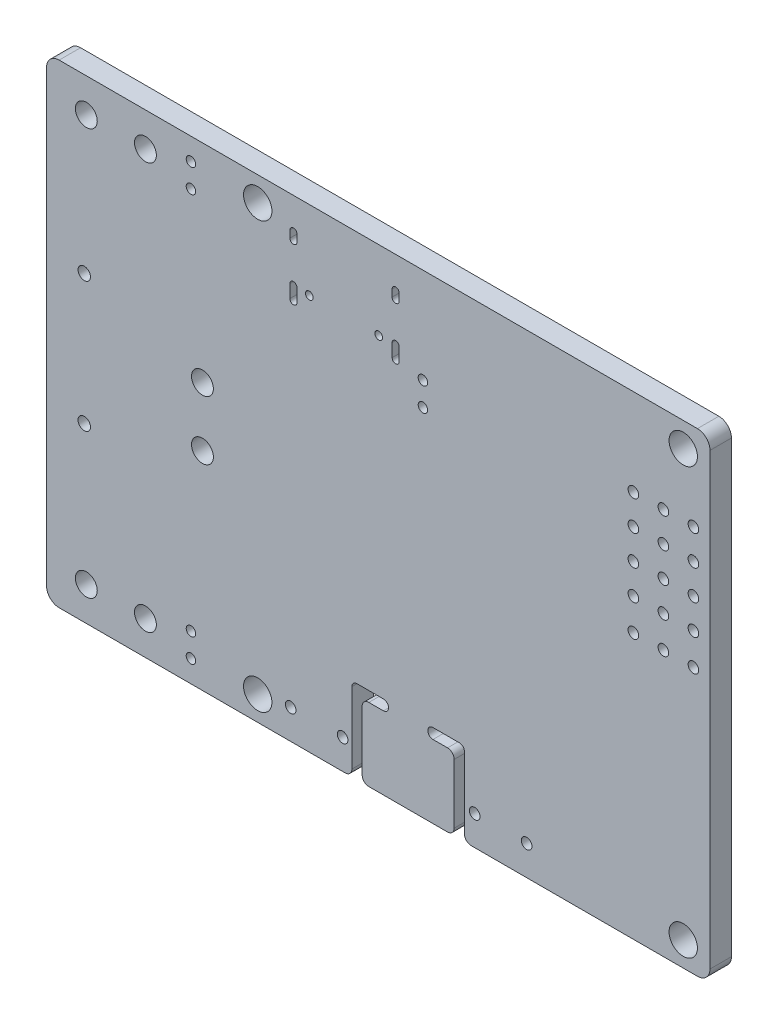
ISO-10303-21;
HEADER;
FILE_DESCRIPTION(('STEP AP214'),'2;1');
FILE_NAME('part.step','',(''),(''),'','','');
FILE_SCHEMA(('AUTOMOTIVE_DESIGN { 1 0 10303 214 1 1 1 1 }'));
ENDSEC;
DATA;
#1=APPLICATION_CONTEXT('core data for automotive mechanical design processes');
#2=APPLICATION_PROTOCOL_DEFINITION('international standard','automotive_design',2000,#1);
#3=PRODUCT_CONTEXT('',#1,'mechanical');
#4=PRODUCT('Part','Part','',(#3));
#5=PRODUCT_RELATED_PRODUCT_CATEGORY('part','',(#4));
#6=PRODUCT_DEFINITION_FORMATION('','',#4);
#7=PRODUCT_DEFINITION_CONTEXT('part definition',#1,'design');
#8=PRODUCT_DEFINITION('design','',#6,#7);
#9=PRODUCT_DEFINITION_SHAPE('','',#8);
#10=(LENGTH_UNIT() NAMED_UNIT(*) SI_UNIT(.MILLI.,.METRE.));
#11=(NAMED_UNIT(*) PLANE_ANGLE_UNIT() SI_UNIT($,.RADIAN.));
#12=(NAMED_UNIT(*) SI_UNIT($,.STERADIAN.) SOLID_ANGLE_UNIT());
#13=UNCERTAINTY_MEASURE_WITH_UNIT(LENGTH_MEASURE(1.E-05),#10,'distance_accuracy_value','');
#14=(GEOMETRIC_REPRESENTATION_CONTEXT(3) GLOBAL_UNCERTAINTY_ASSIGNED_CONTEXT((#13)) GLOBAL_UNIT_ASSIGNED_CONTEXT((#10,
#11,#12)) REPRESENTATION_CONTEXT('',''));
#15=CARTESIAN_POINT('',(0.,0.,0.));
#16=DIRECTION('',(0.,0.,1.));
#17=DIRECTION('',(1.,0.,0.));
#18=AXIS2_PLACEMENT_3D('',#15,#16,#17);
#19=CARTESIAN_POINT('',(3.3,-17.2,0.));
#20=DIRECTION('',(0.,0.,-1.));
#21=DIRECTION('',(0.,1.,0.));
#22=AXIS2_PLACEMENT_3D('',#19,#20,#21);
#23=CYLINDRICAL_SURFACE('',#22,0.925);
#24=CARTESIAN_POINT('',(3.3,-17.2,0.));
#25=DIRECTION('',(0.,0.,1.));
#26=DIRECTION('',(1.,0.,0.));
#27=AXIS2_PLACEMENT_3D('',#24,#25,#26);
#28=CIRCLE('',#27,0.925);
#29=CARTESIAN_POINT('',(4.225,-17.2,0.));
#30=VERTEX_POINT('',#29);
#31=EDGE_CURVE('E985',#30,#30,#28,.T.);
#32=ORIENTED_EDGE('',*,*,#31,.F.);
#33=EDGE_LOOP('',(#32));
#34=FACE_BOUND('',#33,.T.);
#35=CARTESIAN_POINT('',(3.3,-17.2,1.81224174));
#36=DIRECTION('',(0.,0.,1.));
#37=DIRECTION('',(1.,0.,0.));
#38=AXIS2_PLACEMENT_3D('',#35,#36,#37);
#39=CIRCLE('',#38,0.925);
#40=CARTESIAN_POINT('',(4.225,-17.2,1.81224174));
#41=VERTEX_POINT('',#40);
#42=EDGE_CURVE('E519',#41,#41,#39,.T.);
#43=ORIENTED_EDGE('',*,*,#42,.T.);
#44=EDGE_LOOP('',(#43));
#45=FACE_BOUND('',#44,.T.);
#46=ADVANCED_FACE('F17',(#34,#45),#23,.F.);
#47=CARTESIAN_POINT('',(12.15,-18.2,0.));
#48=DIRECTION('',(0.,0.,-1.));
#49=DIRECTION('',(0.,1.,0.));
#50=AXIS2_PLACEMENT_3D('',#47,#48,#49);
#51=CYLINDRICAL_SURFACE('',#50,0.4);
#52=CARTESIAN_POINT('',(12.15,-18.2,0.));
#53=DIRECTION('',(0.,0.,1.));
#54=DIRECTION('',(1.,0.,0.));
#55=AXIS2_PLACEMENT_3D('',#52,#53,#54);
#56=CIRCLE('',#55,0.4);
#57=CARTESIAN_POINT('',(12.55,-18.2,0.));
#58=VERTEX_POINT('',#57);
#59=EDGE_CURVE('E989',#58,#58,#56,.T.);
#60=ORIENTED_EDGE('',*,*,#59,.F.);
#61=EDGE_LOOP('',(#60));
#62=FACE_BOUND('',#61,.T.);
#63=CARTESIAN_POINT('',(12.15,-18.2,1.81224174));
#64=DIRECTION('',(0.,0.,1.));
#65=DIRECTION('',(1.,0.,0.));
#66=AXIS2_PLACEMENT_3D('',#63,#64,#65);
#67=CIRCLE('',#66,0.4);
#68=CARTESIAN_POINT('',(12.55,-18.2,1.81224174));
#69=VERTEX_POINT('',#68);
#70=EDGE_CURVE('E514',#69,#69,#67,.T.);
#71=ORIENTED_EDGE('',*,*,#70,.T.);
#72=EDGE_LOOP('',(#71));
#73=FACE_BOUND('',#72,.T.);
#74=ADVANCED_FACE('F1208',(#62,#73),#51,.F.);
#75=CARTESIAN_POINT('',(3.124,-5.5,0.));
#76=DIRECTION('',(0.,0.,-1.));
#77=DIRECTION('',(0.,1.,0.));
#78=AXIS2_PLACEMENT_3D('',#75,#76,#77);
#79=CYLINDRICAL_SURFACE('',#78,0.525);
#80=CARTESIAN_POINT('',(3.124,-5.5,0.));
#81=DIRECTION('',(0.,0.,1.));
#82=DIRECTION('',(1.,0.,0.));
#83=AXIS2_PLACEMENT_3D('',#80,#81,#82);
#84=CIRCLE('',#83,0.525);
#85=CARTESIAN_POINT('',(3.649,-5.5,0.));
#86=VERTEX_POINT('',#85);
#87=EDGE_CURVE('E993',#86,#86,#84,.T.);
#88=ORIENTED_EDGE('',*,*,#87,.F.);
#89=EDGE_LOOP('',(#88));
#90=FACE_BOUND('',#89,.T.);
#91=CARTESIAN_POINT('',(3.124,-5.5,1.81224174));
#92=DIRECTION('',(0.,0.,1.));
#93=DIRECTION('',(1.,0.,0.));
#94=AXIS2_PLACEMENT_3D('',#91,#92,#93);
#95=CIRCLE('',#94,0.525);
#96=CARTESIAN_POINT('',(3.649,-5.5,1.81224174));
#97=VERTEX_POINT('',#96);
#98=EDGE_CURVE('E518',#97,#97,#95,.T.);
#99=ORIENTED_EDGE('',*,*,#98,.T.);
#100=EDGE_LOOP('',(#99));
#101=FACE_BOUND('',#100,.T.);
#102=ADVANCED_FACE('F1213',(#90,#101),#79,.F.);
#103=CARTESIAN_POINT('',(8.3,-17.2,0.));
#104=DIRECTION('',(0.,0.,-1.));
#105=DIRECTION('',(0.,1.,0.));
#106=AXIS2_PLACEMENT_3D('',#103,#104,#105);
#107=CYLINDRICAL_SURFACE('',#106,0.925);
#108=CARTESIAN_POINT('',(8.3,-17.2,0.));
#109=DIRECTION('',(0.,0.,1.));
#110=DIRECTION('',(1.,0.,0.));
#111=AXIS2_PLACEMENT_3D('',#108,#109,#110);
#112=CIRCLE('',#111,0.925);
#113=CARTESIAN_POINT('',(9.225,-17.2,0.));
#114=VERTEX_POINT('',#113);
#115=EDGE_CURVE('E997',#114,#114,#112,.T.);
#116=ORIENTED_EDGE('',*,*,#115,.F.);
#117=EDGE_LOOP('',(#116));
#118=FACE_BOUND('',#117,.T.);
#119=CARTESIAN_POINT('',(8.3,-17.2,1.81224174));
#120=DIRECTION('',(0.,0.,1.));
#121=DIRECTION('',(1.,0.,0.));
#122=AXIS2_PLACEMENT_3D('',#119,#120,#121);
#123=CIRCLE('',#122,0.925);
#124=CARTESIAN_POINT('',(9.225,-17.2,1.81224174));
#125=VERTEX_POINT('',#124);
#126=EDGE_CURVE('E642',#125,#125,#123,.T.);
#127=ORIENTED_EDGE('',*,*,#126,.T.);
#128=EDGE_LOOP('',(#127));
#129=FACE_BOUND('',#128,.T.);
#130=ADVANCED_FACE('F1585',(#118,#129),#107,.F.);
#131=CARTESIAN_POINT('',(12.15,-16.2,0.));
#132=DIRECTION('',(0.,0.,-1.));
#133=DIRECTION('',(0.,1.,0.));
#134=AXIS2_PLACEMENT_3D('',#131,#132,#133);
#135=CYLINDRICAL_SURFACE('',#134,0.4);
#136=CARTESIAN_POINT('',(12.15,-16.2,0.));
#137=DIRECTION('',(0.,0.,1.));
#138=DIRECTION('',(1.,0.,0.));
#139=AXIS2_PLACEMENT_3D('',#136,#137,#138);
#140=CIRCLE('',#139,0.4);
#141=CARTESIAN_POINT('',(12.55,-16.2,0.));
#142=VERTEX_POINT('',#141);
#143=EDGE_CURVE('E1001',#142,#142,#140,.T.);
#144=ORIENTED_EDGE('',*,*,#143,.F.);
#145=EDGE_LOOP('',(#144));
#146=FACE_BOUND('',#145,.T.);
#147=CARTESIAN_POINT('',(12.15,-16.2,1.81224174));
#148=DIRECTION('',(0.,0.,1.));
#149=DIRECTION('',(1.,0.,0.));
#150=AXIS2_PLACEMENT_3D('',#147,#148,#149);
#151=CIRCLE('',#150,0.4);
#152=CARTESIAN_POINT('',(12.55,-16.2,1.81224174));
#153=VERTEX_POINT('',#152);
#154=EDGE_CURVE('E716',#153,#153,#151,.T.);
#155=ORIENTED_EDGE('',*,*,#154,.T.);
#156=EDGE_LOOP('',(#155));
#157=FACE_BOUND('',#156,.T.);
#158=ADVANCED_FACE('F1590',(#146,#157),#135,.F.);
#159=CARTESIAN_POINT('',(20.588,-17.561,0.));
#160=DIRECTION('',(0.,0.,-1.));
#161=DIRECTION('',(0.,1.,0.));
#162=AXIS2_PLACEMENT_3D('',#159,#160,#161);
#163=CYLINDRICAL_SURFACE('',#162,0.45);
#164=CARTESIAN_POINT('',(20.588,-17.561,0.));
#165=DIRECTION('',(0.,0.,1.));
#166=DIRECTION('',(1.,0.,0.));
#167=AXIS2_PLACEMENT_3D('',#164,#165,#166);
#168=CIRCLE('',#167,0.45);
#169=CARTESIAN_POINT('',(21.038,-17.561,0.));
#170=VERTEX_POINT('',#169);
#171=EDGE_CURVE('E1005',#170,#170,#168,.T.);
#172=ORIENTED_EDGE('',*,*,#171,.F.);
#173=EDGE_LOOP('',(#172));
#174=FACE_BOUND('',#173,.T.);
#175=CARTESIAN_POINT('',(20.588,-17.561,1.81224174));
#176=DIRECTION('',(0.,0.,1.));
#177=DIRECTION('',(1.,0.,0.));
#178=AXIS2_PLACEMENT_3D('',#175,#176,#177);
#179=CIRCLE('',#178,0.45);
#180=CARTESIAN_POINT('',(21.038,-17.561,1.81224174));
#181=VERTEX_POINT('',#180);
#182=EDGE_CURVE('E711',#181,#181,#179,.T.);
#183=ORIENTED_EDGE('',*,*,#182,.T.);
#184=EDGE_LOOP('',(#183));
#185=FACE_BOUND('',#184,.T.);
#186=ADVANCED_FACE('F1478',(#174,#185),#163,.F.);
#187=CARTESIAN_POINT('',(24.982,-17.551,0.));
#188=DIRECTION('',(0.,0.,-1.));
#189=DIRECTION('',(0.,1.,0.));
#190=AXIS2_PLACEMENT_3D('',#187,#188,#189);
#191=CYLINDRICAL_SURFACE('',#190,0.45);
#192=CARTESIAN_POINT('',(24.982,-17.551,0.));
#193=DIRECTION('',(0.,0.,1.));
#194=DIRECTION('',(1.,0.,0.));
#195=AXIS2_PLACEMENT_3D('',#192,#193,#194);
#196=CIRCLE('',#195,0.45);
#197=CARTESIAN_POINT('',(25.432,-17.551,0.));
#198=VERTEX_POINT('',#197);
#199=EDGE_CURVE('E1009',#198,#198,#196,.T.);
#200=ORIENTED_EDGE('',*,*,#199,.F.);
#201=EDGE_LOOP('',(#200));
#202=FACE_BOUND('',#201,.T.);
#203=CARTESIAN_POINT('',(24.982,-17.551,1.81224174));
#204=DIRECTION('',(0.,0.,1.));
#205=DIRECTION('',(1.,0.,0.));
#206=AXIS2_PLACEMENT_3D('',#203,#204,#205);
#207=CIRCLE('',#206,0.45);
#208=CARTESIAN_POINT('',(25.432,-17.551,1.81224174));
#209=VERTEX_POINT('',#208);
#210=EDGE_CURVE('E715',#209,#209,#207,.T.);
#211=ORIENTED_EDGE('',*,*,#210,.T.);
#212=EDGE_LOOP('',(#211));
#213=FACE_BOUND('',#212,.T.);
#214=ADVANCED_FACE('F1474',(#202,#213),#191,.F.);
#215=CARTESIAN_POINT('',(13.124,2.5,0.));
#216=DIRECTION('',(0.,0.,-1.));
#217=DIRECTION('',(0.,1.,0.));
#218=AXIS2_PLACEMENT_3D('',#215,#216,#217);
#219=CYLINDRICAL_SURFACE('',#218,0.925);
#220=CARTESIAN_POINT('',(13.124,2.5,0.));
#221=DIRECTION('',(0.,0.,1.));
#222=DIRECTION('',(1.,0.,0.));
#223=AXIS2_PLACEMENT_3D('',#220,#221,#222);
#224=CIRCLE('',#223,0.925);
#225=CARTESIAN_POINT('',(14.049,2.5,0.));
#226=VERTEX_POINT('',#225);
#227=EDGE_CURVE('E1013',#226,#226,#224,.T.);
#228=ORIENTED_EDGE('',*,*,#227,.F.);
#229=EDGE_LOOP('',(#228));
#230=FACE_BOUND('',#229,.T.);
#231=CARTESIAN_POINT('',(13.124,2.5,1.81224174));
#232=DIRECTION('',(0.,0.,1.));
#233=DIRECTION('',(1.,0.,0.));
#234=AXIS2_PLACEMENT_3D('',#231,#232,#233);
#235=CIRCLE('',#234,0.925);
#236=CARTESIAN_POINT('',(14.049,2.5,1.81224174));
#237=VERTEX_POINT('',#236);
#238=EDGE_CURVE('E478',#237,#237,#235,.T.);
#239=ORIENTED_EDGE('',*,*,#238,.T.);
#240=EDGE_LOOP('',(#239));
#241=FACE_BOUND('',#240,.T.);
#242=ADVANCED_FACE('F1477',(#230,#241),#219,.F.);
#243=CARTESIAN_POINT('',(17.8,-18.,0.));
#244=DIRECTION('',(0.,0.,-1.));
#245=DIRECTION('',(0.,1.,0.));
#246=AXIS2_PLACEMENT_3D('',#243,#244,#245);
#247=CYLINDRICAL_SURFACE('',#246,1.2);
#248=CARTESIAN_POINT('',(17.8,-18.,0.));
#249=DIRECTION('',(0.,0.,1.));
#250=DIRECTION('',(1.,0.,0.));
#251=AXIS2_PLACEMENT_3D('',#248,#249,#250);
#252=CIRCLE('',#251,1.2);
#253=CARTESIAN_POINT('',(19.,-18.,0.));
#254=VERTEX_POINT('',#253);
#255=EDGE_CURVE('E1017',#254,#254,#252,.T.);
#256=ORIENTED_EDGE('',*,*,#255,.F.);
#257=EDGE_LOOP('',(#256));
#258=FACE_BOUND('',#257,.T.);
#259=CARTESIAN_POINT('',(17.8,-18.,1.81224174));
#260=DIRECTION('',(0.,0.,1.));
#261=DIRECTION('',(1.,0.,0.));
#262=AXIS2_PLACEMENT_3D('',#259,#260,#261);
#263=CIRCLE('',#262,1.2);
#264=CARTESIAN_POINT('',(19.,-18.,1.81224174));
#265=VERTEX_POINT('',#264);
#266=EDGE_CURVE('E473',#265,#265,#263,.T.);
#267=ORIENTED_EDGE('',*,*,#266,.T.);
#268=EDGE_LOOP('',(#267));
#269=FACE_BOUND('',#268,.T.);
#270=ADVANCED_FACE('F1555',(#258,#269),#247,.F.);
#271=CARTESIAN_POINT('',(13.124,-2.5,0.));
#272=DIRECTION('',(0.,0.,-1.));
#273=DIRECTION('',(0.,1.,0.));
#274=AXIS2_PLACEMENT_3D('',#271,#272,#273);
#275=CYLINDRICAL_SURFACE('',#274,0.925);
#276=CARTESIAN_POINT('',(13.124,-2.5,0.));
#277=DIRECTION('',(0.,0.,1.));
#278=DIRECTION('',(1.,0.,0.));
#279=AXIS2_PLACEMENT_3D('',#276,#277,#278);
#280=CIRCLE('',#279,0.925);
#281=CARTESIAN_POINT('',(14.049,-2.5,0.));
#282=VERTEX_POINT('',#281);
#283=EDGE_CURVE('E1021',#282,#282,#280,.T.);
#284=ORIENTED_EDGE('',*,*,#283,.F.);
#285=EDGE_LOOP('',(#284));
#286=FACE_BOUND('',#285,.T.);
#287=CARTESIAN_POINT('',(13.124,-2.5,1.81224174));
#288=DIRECTION('',(0.,0.,1.));
#289=DIRECTION('',(1.,0.,0.));
#290=AXIS2_PLACEMENT_3D('',#287,#288,#289);
#291=CIRCLE('',#290,0.925);
#292=CARTESIAN_POINT('',(14.049,-2.5,1.81224174));
#293=VERTEX_POINT('',#292);
#294=EDGE_CURVE('E477',#293,#293,#291,.T.);
#295=ORIENTED_EDGE('',*,*,#294,.T.);
#296=EDGE_LOOP('',(#295));
#297=FACE_BOUND('',#296,.T.);
#298=ADVANCED_FACE('F1447',(#286,#297),#275,.F.);
#299=CARTESIAN_POINT('',(3.124,5.5,0.));
#300=DIRECTION('',(0.,0.,-1.));
#301=DIRECTION('',(0.,1.,0.));
#302=AXIS2_PLACEMENT_3D('',#299,#300,#301);
#303=CYLINDRICAL_SURFACE('',#302,0.525);
#304=CARTESIAN_POINT('',(3.124,5.5,0.));
#305=DIRECTION('',(0.,0.,1.));
#306=DIRECTION('',(1.,0.,0.));
#307=AXIS2_PLACEMENT_3D('',#304,#305,#306);
#308=CIRCLE('',#307,0.525);
#309=CARTESIAN_POINT('',(3.649,5.5,0.));
#310=VERTEX_POINT('',#309);
#311=EDGE_CURVE('E1025',#310,#310,#308,.T.);
#312=ORIENTED_EDGE('',*,*,#311,.F.);
#313=EDGE_LOOP('',(#312));
#314=FACE_BOUND('',#313,.T.);
#315=CARTESIAN_POINT('',(3.124,5.5,1.81224174));
#316=DIRECTION('',(0.,0.,1.));
#317=DIRECTION('',(1.,0.,0.));
#318=AXIS2_PLACEMENT_3D('',#315,#316,#317);
#319=CIRCLE('',#318,0.525);
#320=CARTESIAN_POINT('',(3.649,5.5,1.81224174));
#321=VERTEX_POINT('',#320);
#322=EDGE_CURVE('E626',#321,#321,#319,.T.);
#323=ORIENTED_EDGE('',*,*,#322,.T.);
#324=EDGE_LOOP('',(#323));
#325=FACE_BOUND('',#324,.T.);
#326=ADVANCED_FACE('F1444',(#314,#325),#303,.F.);
#327=CARTESIAN_POINT('',(12.15,16.2,0.));
#328=DIRECTION('',(0.,0.,-1.));
#329=DIRECTION('',(0.,1.,0.));
#330=AXIS2_PLACEMENT_3D('',#327,#328,#329);
#331=CYLINDRICAL_SURFACE('',#330,0.4);
#332=CARTESIAN_POINT('',(12.15,16.2,0.));
#333=DIRECTION('',(0.,0.,1.));
#334=DIRECTION('',(1.,0.,0.));
#335=AXIS2_PLACEMENT_3D('',#332,#333,#334);
#336=CIRCLE('',#335,0.4);
#337=CARTESIAN_POINT('',(12.55,16.2,0.));
#338=VERTEX_POINT('',#337);
#339=EDGE_CURVE('E875',#338,#338,#336,.T.);
#340=ORIENTED_EDGE('',*,*,#339,.F.);
#341=EDGE_LOOP('',(#340));
#342=FACE_BOUND('',#341,.T.);
#343=CARTESIAN_POINT('',(12.15,16.2,1.81224174));
#344=DIRECTION('',(0.,0.,1.));
#345=DIRECTION('',(1.,0.,0.));
#346=AXIS2_PLACEMENT_3D('',#343,#344,#345);
#347=CIRCLE('',#346,0.4);
#348=CARTESIAN_POINT('',(12.55,16.2,1.81224174));
#349=VERTEX_POINT('',#348);
#350=EDGE_CURVE('E758',#349,#349,#347,.T.);
#351=ORIENTED_EDGE('',*,*,#350,.T.);
#352=EDGE_LOOP('',(#351));
#353=FACE_BOUND('',#352,.T.);
#354=ADVANCED_FACE('F1366',(#342,#353),#331,.F.);
#355=CARTESIAN_POINT('',(3.3,17.2,0.));
#356=DIRECTION('',(0.,0.,-1.));
#357=DIRECTION('',(0.,1.,0.));
#358=AXIS2_PLACEMENT_3D('',#355,#356,#357);
#359=CYLINDRICAL_SURFACE('',#358,0.925);
#360=CARTESIAN_POINT('',(3.3,17.2,0.));
#361=DIRECTION('',(0.,0.,1.));
#362=DIRECTION('',(1.,0.,0.));
#363=AXIS2_PLACEMENT_3D('',#360,#361,#362);
#364=CIRCLE('',#363,0.925);
#365=CARTESIAN_POINT('',(4.225,17.2,0.));
#366=VERTEX_POINT('',#365);
#367=EDGE_CURVE('E867',#366,#366,#364,.T.);
#368=ORIENTED_EDGE('',*,*,#367,.F.);
#369=EDGE_LOOP('',(#368));
#370=FACE_BOUND('',#369,.T.);
#371=CARTESIAN_POINT('',(3.3,17.2,1.81224174));
#372=DIRECTION('',(0.,0.,1.));
#373=DIRECTION('',(1.,0.,0.));
#374=AXIS2_PLACEMENT_3D('',#371,#372,#373);
#375=CIRCLE('',#374,0.925);
#376=CARTESIAN_POINT('',(4.225,17.2,1.81224174));
#377=VERTEX_POINT('',#376);
#378=EDGE_CURVE('E586',#377,#377,#375,.T.);
#379=ORIENTED_EDGE('',*,*,#378,.T.);
#380=EDGE_LOOP('',(#379));
#381=FACE_BOUND('',#380,.T.);
#382=ADVANCED_FACE('F1363',(#370,#381),#359,.F.);
#383=CARTESIAN_POINT('',(8.3,17.2,0.));
#384=DIRECTION('',(0.,0.,-1.));
#385=DIRECTION('',(0.,1.,0.));
#386=AXIS2_PLACEMENT_3D('',#383,#384,#385);
#387=CYLINDRICAL_SURFACE('',#386,0.925);
#388=CARTESIAN_POINT('',(8.3,17.2,0.));
#389=DIRECTION('',(0.,0.,1.));
#390=DIRECTION('',(1.,0.,0.));
#391=AXIS2_PLACEMENT_3D('',#388,#389,#390);
#392=CIRCLE('',#391,0.925);
#393=CARTESIAN_POINT('',(9.225,17.2,0.));
#394=VERTEX_POINT('',#393);
#395=EDGE_CURVE('E862',#394,#394,#392,.T.);
#396=ORIENTED_EDGE('',*,*,#395,.F.);
#397=EDGE_LOOP('',(#396));
#398=FACE_BOUND('',#397,.T.);
#399=CARTESIAN_POINT('',(8.3,17.2,1.81224174));
#400=DIRECTION('',(0.,0.,1.));
#401=DIRECTION('',(1.,0.,0.));
#402=AXIS2_PLACEMENT_3D('',#399,#400,#401);
#403=CIRCLE('',#402,0.925);
#404=CARTESIAN_POINT('',(9.225,17.2,1.81224174));
#405=VERTEX_POINT('',#404);
#406=EDGE_CURVE('E581',#405,#405,#403,.T.);
#407=ORIENTED_EDGE('',*,*,#406,.T.);
#408=EDGE_LOOP('',(#407));
#409=FACE_BOUND('',#408,.T.);
#410=ADVANCED_FACE('F1365',(#398,#409),#387,.F.);
#411=CARTESIAN_POINT('',(12.15,18.2,0.));
#412=DIRECTION('',(0.,0.,-1.));
#413=DIRECTION('',(0.,1.,0.));
#414=AXIS2_PLACEMENT_3D('',#411,#412,#413);
#415=CYLINDRICAL_SURFACE('',#414,0.4);
#416=CARTESIAN_POINT('',(12.15,18.2,0.));
#417=DIRECTION('',(0.,0.,1.));
#418=DIRECTION('',(1.,0.,0.));
#419=AXIS2_PLACEMENT_3D('',#416,#417,#418);
#420=CIRCLE('',#419,0.4);
#421=CARTESIAN_POINT('',(12.55,18.2,0.));
#422=VERTEX_POINT('',#421);
#423=EDGE_CURVE('E866',#422,#422,#420,.T.);
#424=ORIENTED_EDGE('',*,*,#423,.F.);
#425=EDGE_LOOP('',(#424));
#426=FACE_BOUND('',#425,.T.);
#427=CARTESIAN_POINT('',(12.15,18.2,1.81224174));
#428=DIRECTION('',(0.,0.,1.));
#429=DIRECTION('',(1.,0.,0.));
#430=AXIS2_PLACEMENT_3D('',#427,#428,#429);
#431=CIRCLE('',#430,0.4);
#432=CARTESIAN_POINT('',(12.55,18.2,1.81224174));
#433=VERTEX_POINT('',#432);
#434=EDGE_CURVE('E585',#433,#433,#431,.T.);
#435=ORIENTED_EDGE('',*,*,#434,.T.);
#436=EDGE_LOOP('',(#435));
#437=FACE_BOUND('',#436,.T.);
#438=ADVANCED_FACE('F1469',(#426,#437),#415,.F.);
#439=CARTESIAN_POINT('',(21.12099916,12.34790012,0.));
#440=DIRECTION('',(-1.,0.,0.));
#441=DIRECTION('',(0.,0.,1.));
#442=AXIS2_PLACEMENT_3D('',#439,#440,#441);
#443=PLANE('',#442);
#444=DIRECTION('',(0.,0.,1.));
#445=VECTOR('',#444,1.);
#446=CARTESIAN_POINT('',(21.12099916,12.34790012,0.));
#447=LINE('',#446,#445);
#448=CARTESIAN_POINT('',(21.12099916,12.34790012,0.));
#449=VERTEX_POINT('',#448);
#450=CARTESIAN_POINT('',(21.12099916,12.34790012,1.81224174));
#451=VERTEX_POINT('',#450);
#452=EDGE_CURVE('E11',#449,#451,#447,.T.);
#453=ORIENTED_EDGE('',*,*,#452,.T.);
#454=DIRECTION('',(0.,1.,0.));
#455=VECTOR('',#454,1.);
#456=CARTESIAN_POINT('',(21.12099916,12.34790012,1.81224174));
#457=LINE('',#456,#455);
#458=CARTESIAN_POINT('',(21.12099916,13.44789792,1.81224174));
#459=VERTEX_POINT('',#458);
#460=EDGE_CURVE('E687',#451,#459,#457,.T.);
#461=ORIENTED_EDGE('',*,*,#460,.T.);
#462=DIRECTION('',(0.,0.,1.));
#463=VECTOR('',#462,1.);
#464=CARTESIAN_POINT('',(21.12099916,13.44789792,0.));
#465=LINE('',#464,#463);
#466=CARTESIAN_POINT('',(21.12099916,13.44789792,0.));
#467=VERTEX_POINT('',#466);
#468=EDGE_CURVE('E658',#467,#459,#465,.T.);
#469=ORIENTED_EDGE('',*,*,#468,.F.);
#470=DIRECTION('',(0.,1.,0.));
#471=VECTOR('',#470,1.);
#472=CARTESIAN_POINT('',(21.12099916,12.34790012,0.));
#473=LINE('',#472,#471);
#474=EDGE_CURVE('E1043',#449,#467,#473,.T.);
#475=ORIENTED_EDGE('',*,*,#474,.F.);
#476=EDGE_LOOP('',(#453,#461,#469,#475));
#477=FACE_BOUND('',#476,.T.);
#478=ADVANCED_FACE('F1187',(#477),#443,.T.);
#479=CARTESIAN_POINT('',(20.82099976,12.34790012,0.));
#480=DIRECTION('',(0.,0.,-1.));
#481=DIRECTION('',(0.,1.,0.));
#482=AXIS2_PLACEMENT_3D('',#479,#480,#481);
#483=CYLINDRICAL_SURFACE('',#482,0.2999994);
#484=DIRECTION('',(0.,0.,1.));
#485=VECTOR('',#484,1.);
#486=CARTESIAN_POINT('',(20.52100036,12.34790012,0.));
#487=LINE('',#486,#485);
#488=CARTESIAN_POINT('',(20.52100036,12.34790012,0.));
#489=VERTEX_POINT('',#488);
#490=CARTESIAN_POINT('',(20.52100036,12.34790012,1.81224174));
#491=VERTEX_POINT('',#490);
#492=EDGE_CURVE('E25',#489,#491,#487,.T.);
#493=ORIENTED_EDGE('',*,*,#492,.T.);
#494=CARTESIAN_POINT('',(20.82099976,12.34790012,1.81224174));
#495=DIRECTION('',(0.,0.,1.));
#496=DIRECTION('',(-1.,0.,0.));
#497=AXIS2_PLACEMENT_3D('',#494,#495,#496);
#498=CIRCLE('',#497,0.2999994);
#499=EDGE_CURVE('E682',#491,#451,#498,.T.);
#500=ORIENTED_EDGE('',*,*,#499,.T.);
#501=ORIENTED_EDGE('',*,*,#452,.F.);
#502=CARTESIAN_POINT('',(20.82099976,12.34790012,0.));
#503=DIRECTION('',(0.,0.,1.));
#504=DIRECTION('',(-1.,0.,0.));
#505=AXIS2_PLACEMENT_3D('',#502,#503,#504);
#506=CIRCLE('',#505,0.2999994);
#507=EDGE_CURVE('E1039',#489,#449,#506,.T.);
#508=ORIENTED_EDGE('',*,*,#507,.F.);
#509=EDGE_LOOP('',(#493,#500,#501,#508));
#510=FACE_BOUND('',#509,.T.);
#511=ADVANCED_FACE('F1175',(#510),#483,.F.);
#512=CARTESIAN_POINT('',(20.52100036,13.44789792,0.));
#513=DIRECTION('',(1.,0.,0.));
#514=DIRECTION('',(0.,1.,0.));
#515=AXIS2_PLACEMENT_3D('',#512,#513,#514);
#516=PLANE('',#515);
#517=DIRECTION('',(0.,0.,1.));
#518=VECTOR('',#517,1.);
#519=CARTESIAN_POINT('',(20.52100036,13.44789792,0.));
#520=LINE('',#519,#518);
#521=CARTESIAN_POINT('',(20.52100036,13.44789792,0.));
#522=VERTEX_POINT('',#521);
#523=CARTESIAN_POINT('',(20.52100036,13.44789792,1.81224174));
#524=VERTEX_POINT('',#523);
#525=EDGE_CURVE('E1151',#522,#524,#520,.T.);
#526=ORIENTED_EDGE('',*,*,#525,.T.);
#527=DIRECTION('',(0.,-1.,0.));
#528=VECTOR('',#527,1.);
#529=CARTESIAN_POINT('',(20.52100036,13.44789792,1.81224174));
#530=LINE('',#529,#528);
#531=EDGE_CURVE('E686',#524,#491,#530,.T.);
#532=ORIENTED_EDGE('',*,*,#531,.T.);
#533=ORIENTED_EDGE('',*,*,#492,.F.);
#534=DIRECTION('',(0.,-1.,0.));
#535=VECTOR('',#534,1.);
#536=CARTESIAN_POINT('',(20.52100036,13.44789792,0.));
#537=LINE('',#536,#535);
#538=EDGE_CURVE('E1035',#522,#489,#537,.T.);
#539=ORIENTED_EDGE('',*,*,#538,.F.);
#540=EDGE_LOOP('',(#526,#532,#533,#539));
#541=FACE_BOUND('',#540,.T.);
#542=ADVANCED_FACE('F1181',(#541),#516,.T.);
#543=CARTESIAN_POINT('',(20.82099976,13.44789792,0.));
#544=DIRECTION('',(0.,0.,-1.));
#545=DIRECTION('',(0.,-1.,0.));
#546=AXIS2_PLACEMENT_3D('',#543,#544,#545);
#547=CYLINDRICAL_SURFACE('',#546,0.2999994);
#548=ORIENTED_EDGE('',*,*,#468,.T.);
#549=CARTESIAN_POINT('',(20.82099976,13.44789792,1.81224174));
#550=DIRECTION('',(0.,0.,1.));
#551=DIRECTION('',(1.,0.,0.));
#552=AXIS2_PLACEMENT_3D('',#549,#550,#551);
#553=CIRCLE('',#552,0.2999994);
#554=EDGE_CURVE('E790',#459,#524,#553,.T.);
#555=ORIENTED_EDGE('',*,*,#554,.T.);
#556=ORIENTED_EDGE('',*,*,#525,.F.);
#557=CARTESIAN_POINT('',(20.82099976,13.44789792,0.));
#558=DIRECTION('',(0.,0.,1.));
#559=DIRECTION('',(1.,0.,0.));
#560=AXIS2_PLACEMENT_3D('',#557,#558,#559);
#561=CIRCLE('',#560,0.2999994);
#562=EDGE_CURVE('E822',#467,#522,#561,.T.);
#563=ORIENTED_EDGE('',*,*,#562,.F.);
#564=EDGE_LOOP('',(#548,#555,#556,#563));
#565=FACE_BOUND('',#564,.T.);
#566=ADVANCED_FACE('F1193',(#565),#547,.F.);
#567=CARTESIAN_POINT('',(28.036,13.398,0.));
#568=DIRECTION('',(0.,0.,-1.));
#569=DIRECTION('',(0.,1.,0.));
#570=AXIS2_PLACEMENT_3D('',#567,#568,#569);
#571=CYLINDRICAL_SURFACE('',#570,0.325);
#572=CARTESIAN_POINT('',(28.036,13.398,0.));
#573=DIRECTION('',(0.,0.,1.));
#574=DIRECTION('',(1.,0.,0.));
#575=AXIS2_PLACEMENT_3D('',#572,#573,#574);
#576=CIRCLE('',#575,0.325);
#577=CARTESIAN_POINT('',(28.361,13.398,0.));
#578=VERTEX_POINT('',#577);
#579=EDGE_CURVE('E817',#578,#578,#576,.T.);
#580=ORIENTED_EDGE('',*,*,#579,.F.);
#581=EDGE_LOOP('',(#580));
#582=FACE_BOUND('',#581,.T.);
#583=CARTESIAN_POINT('',(28.036,13.398,1.81224174));
#584=DIRECTION('',(0.,0.,1.));
#585=DIRECTION('',(1.,0.,0.));
#586=AXIS2_PLACEMENT_3D('',#583,#584,#585);
#587=CIRCLE('',#586,0.325);
#588=CARTESIAN_POINT('',(28.361,13.398,1.81224174));
#589=VERTEX_POINT('',#588);
#590=EDGE_CURVE('E708',#589,#589,#587,.T.);
#591=ORIENTED_EDGE('',*,*,#590,.T.);
#592=EDGE_LOOP('',(#591));
#593=FACE_BOUND('',#592,.T.);
#594=ADVANCED_FACE('F1195',(#582,#593),#571,.F.);
#595=CARTESIAN_POINT('',(22.166,13.398,0.));
#596=DIRECTION('',(0.,0.,-1.));
#597=DIRECTION('',(0.,1.,0.));
#598=AXIS2_PLACEMENT_3D('',#595,#596,#597);
#599=CYLINDRICAL_SURFACE('',#598,0.325);
#600=CARTESIAN_POINT('',(22.166,13.398,0.));
#601=DIRECTION('',(0.,0.,1.));
#602=DIRECTION('',(1.,0.,0.));
#603=AXIS2_PLACEMENT_3D('',#600,#601,#602);
#604=CIRCLE('',#603,0.325);
#605=CARTESIAN_POINT('',(22.491,13.398,0.));
#606=VERTEX_POINT('',#605);
#607=EDGE_CURVE('E821',#606,#606,#604,.T.);
#608=ORIENTED_EDGE('',*,*,#607,.F.);
#609=EDGE_LOOP('',(#608));
#610=FACE_BOUND('',#609,.T.);
#611=CARTESIAN_POINT('',(22.166,13.398,1.81224174));
#612=DIRECTION('',(0.,0.,1.));
#613=DIRECTION('',(1.,0.,0.));
#614=AXIS2_PLACEMENT_3D('',#611,#612,#613);
#615=CIRCLE('',#614,0.325);
#616=CARTESIAN_POINT('',(22.491,13.398,1.81224174));
#617=VERTEX_POINT('',#616);
#618=EDGE_CURVE('E794',#617,#617,#615,.T.);
#619=ORIENTED_EDGE('',*,*,#618,.T.);
#620=EDGE_LOOP('',(#619));
#621=FACE_BOUND('',#620,.T.);
#622=ADVANCED_FACE('F1202',(#610,#621),#599,.F.);
#623=CARTESIAN_POINT('',(17.8,18.,0.));
#624=DIRECTION('',(0.,0.,-1.));
#625=DIRECTION('',(0.,1.,0.));
#626=AXIS2_PLACEMENT_3D('',#623,#624,#625);
#627=CYLINDRICAL_SURFACE('',#626,1.2);
#628=CARTESIAN_POINT('',(17.8,18.,0.));
#629=DIRECTION('',(0.,0.,1.));
#630=DIRECTION('',(1.,0.,0.));
#631=AXIS2_PLACEMENT_3D('',#628,#629,#630);
#632=CIRCLE('',#631,1.2);
#633=CARTESIAN_POINT('',(19.,18.,0.));
#634=VERTEX_POINT('',#633);
#635=EDGE_CURVE('E955',#634,#634,#632,.T.);
#636=ORIENTED_EDGE('',*,*,#635,.F.);
#637=EDGE_LOOP('',(#636));
#638=FACE_BOUND('',#637,.T.);
#639=CARTESIAN_POINT('',(17.8,18.,1.81224174));
#640=DIRECTION('',(0.,0.,1.));
#641=DIRECTION('',(1.,0.,0.));
#642=AXIS2_PLACEMENT_3D('',#639,#640,#641);
#643=CIRCLE('',#642,1.2);
#644=CARTESIAN_POINT('',(19.,18.,1.81224174));
#645=VERTEX_POINT('',#644);
#646=EDGE_CURVE('E773',#645,#645,#643,.T.);
#647=ORIENTED_EDGE('',*,*,#646,.T.);
#648=EDGE_LOOP('',(#647));
#649=FACE_BOUND('',#648,.T.);
#650=ADVANCED_FACE('F1383',(#638,#649),#627,.F.);
#651=CARTESIAN_POINT('',(29.77099964,12.34790012,0.));
#652=DIRECTION('',(-1.,0.,0.));
#653=DIRECTION('',(0.,0.,1.));
#654=AXIS2_PLACEMENT_3D('',#651,#652,#653);
#655=PLANE('',#654);
#656=DIRECTION('',(0.,0.,1.));
#657=VECTOR('',#656,1.);
#658=CARTESIAN_POINT('',(29.77099964,12.34790012,0.));
#659=LINE('',#658,#657);
#660=CARTESIAN_POINT('',(29.77099964,12.34790012,0.));
#661=VERTEX_POINT('',#660);
#662=CARTESIAN_POINT('',(29.77099964,12.34790012,1.81224174));
#663=VERTEX_POINT('',#662);
#664=EDGE_CURVE('E655',#661,#663,#659,.T.);
#665=ORIENTED_EDGE('',*,*,#664,.T.);
#666=DIRECTION('',(0.,1.,0.));
#667=VECTOR('',#666,1.);
#668=CARTESIAN_POINT('',(29.77099964,12.34790012,1.81224174));
#669=LINE('',#668,#667);
#670=CARTESIAN_POINT('',(29.77099964,13.44789792,1.81224174));
#671=VERTEX_POINT('',#670);
#672=EDGE_CURVE('E772',#663,#671,#669,.T.);
#673=ORIENTED_EDGE('',*,*,#672,.T.);
#674=DIRECTION('',(0.,0.,1.));
#675=VECTOR('',#674,1.);
#676=CARTESIAN_POINT('',(29.77099964,13.44789792,0.));
#677=LINE('',#676,#675);
#678=CARTESIAN_POINT('',(29.77099964,13.44789792,0.));
#679=VERTEX_POINT('',#678);
#680=EDGE_CURVE('E1161',#679,#671,#677,.T.);
#681=ORIENTED_EDGE('',*,*,#680,.F.);
#682=DIRECTION('',(0.,1.,0.));
#683=VECTOR('',#682,1.);
#684=CARTESIAN_POINT('',(29.77099964,12.34790012,0.));
#685=LINE('',#684,#683);
#686=EDGE_CURVE('E920',#661,#679,#685,.T.);
#687=ORIENTED_EDGE('',*,*,#686,.F.);
#688=EDGE_LOOP('',(#665,#673,#681,#687));
#689=FACE_BOUND('',#688,.T.);
#690=ADVANCED_FACE('F1386',(#689),#655,.T.);
#691=CARTESIAN_POINT('',(29.47100024,12.34790012,0.));
#692=DIRECTION('',(0.,0.,-1.));
#693=DIRECTION('',(0.,1.,0.));
#694=AXIS2_PLACEMENT_3D('',#691,#692,#693);
#695=CYLINDRICAL_SURFACE('',#694,0.2999994);
#696=DIRECTION('',(0.,0.,1.));
#697=VECTOR('',#696,1.);
#698=CARTESIAN_POINT('',(29.17100084,12.34790012,0.));
#699=LINE('',#698,#697);
#700=CARTESIAN_POINT('',(29.17100084,12.34790012,0.));
#701=VERTEX_POINT('',#700);
#702=CARTESIAN_POINT('',(29.17100084,12.34790012,1.81224174));
#703=VERTEX_POINT('',#702);
#704=EDGE_CURVE('E659',#701,#703,#699,.T.);
#705=ORIENTED_EDGE('',*,*,#704,.T.);
#706=CARTESIAN_POINT('',(29.47100024,12.34790012,1.81224174));
#707=DIRECTION('',(0.,0.,1.));
#708=DIRECTION('',(-1.,0.,0.));
#709=AXIS2_PLACEMENT_3D('',#706,#707,#708);
#710=CIRCLE('',#709,0.2999994);
#711=EDGE_CURVE('E832',#703,#663,#710,.T.);
#712=ORIENTED_EDGE('',*,*,#711,.T.);
#713=ORIENTED_EDGE('',*,*,#664,.F.);
#714=CARTESIAN_POINT('',(29.47100024,12.34790012,0.));
#715=DIRECTION('',(0.,0.,1.));
#716=DIRECTION('',(-1.,0.,0.));
#717=AXIS2_PLACEMENT_3D('',#714,#715,#716);
#718=CIRCLE('',#717,0.2999994);
#719=EDGE_CURVE('E916',#701,#661,#718,.T.);
#720=ORIENTED_EDGE('',*,*,#719,.F.);
#721=EDGE_LOOP('',(#705,#712,#713,#720));
#722=FACE_BOUND('',#721,.T.);
#723=ADVANCED_FACE('F1543',(#722),#695,.F.);
#724=CARTESIAN_POINT('',(29.17100084,13.44789792,0.));
#725=DIRECTION('',(1.,0.,0.));
#726=DIRECTION('',(0.,1.,0.));
#727=AXIS2_PLACEMENT_3D('',#724,#725,#726);
#728=PLANE('',#727);
#729=DIRECTION('',(0.,0.,1.));
#730=VECTOR('',#729,1.);
#731=CARTESIAN_POINT('',(29.17100084,13.44789792,0.));
#732=LINE('',#731,#730);
#733=CARTESIAN_POINT('',(29.17100084,13.44789792,0.));
#734=VERTEX_POINT('',#733);
#735=CARTESIAN_POINT('',(29.17100084,13.44789792,1.81224174));
#736=VERTEX_POINT('',#735);
#737=EDGE_CURVE('E1164',#734,#736,#732,.T.);
#738=ORIENTED_EDGE('',*,*,#737,.T.);
#739=DIRECTION('',(0.,-1.,0.));
#740=VECTOR('',#739,1.);
#741=CARTESIAN_POINT('',(29.17100084,13.44789792,1.81224174));
#742=LINE('',#741,#740);
#743=EDGE_CURVE('E839',#736,#703,#742,.T.);
#744=ORIENTED_EDGE('',*,*,#743,.T.);
#745=ORIENTED_EDGE('',*,*,#704,.F.);
#746=DIRECTION('',(0.,-1.,0.));
#747=VECTOR('',#746,1.);
#748=CARTESIAN_POINT('',(29.17100084,13.44789792,0.));
#749=LINE('',#748,#747);
#750=EDGE_CURVE('E921',#734,#701,#749,.T.);
#751=ORIENTED_EDGE('',*,*,#750,.F.);
#752=EDGE_LOOP('',(#738,#744,#745,#751));
#753=FACE_BOUND('',#752,.T.);
#754=ADVANCED_FACE('F1547',(#753),#728,.T.);
#755=CARTESIAN_POINT('',(29.47100024,13.44789792,0.));
#756=DIRECTION('',(0.,0.,-1.));
#757=DIRECTION('',(0.,-1.,0.));
#758=AXIS2_PLACEMENT_3D('',#755,#756,#757);
#759=CYLINDRICAL_SURFACE('',#758,0.2999994);
#760=ORIENTED_EDGE('',*,*,#680,.T.);
#761=CARTESIAN_POINT('',(29.47100024,13.44789792,1.81224174));
#762=DIRECTION('',(0.,0.,1.));
#763=DIRECTION('',(1.,0.,0.));
#764=AXIS2_PLACEMENT_3D('',#761,#762,#763);
#765=CIRCLE('',#764,0.2999994);
#766=EDGE_CURVE('E768',#671,#736,#765,.T.);
#767=ORIENTED_EDGE('',*,*,#766,.T.);
#768=ORIENTED_EDGE('',*,*,#737,.F.);
#769=CARTESIAN_POINT('',(29.47100024,13.44789792,0.));
#770=DIRECTION('',(0.,0.,1.));
#771=DIRECTION('',(1.,0.,0.));
#772=AXIS2_PLACEMENT_3D('',#769,#770,#771);
#773=CIRCLE('',#772,0.2999994);
#774=EDGE_CURVE('E1059',#679,#734,#773,.T.);
#775=ORIENTED_EDGE('',*,*,#774,.F.);
#776=EDGE_LOOP('',(#760,#767,#768,#775));
#777=FACE_BOUND('',#776,.T.);
#778=ADVANCED_FACE('F1539',(#777),#759,.F.);
#779=CARTESIAN_POINT('',(21.12099916,16.77789888,0.));
#780=DIRECTION('',(-1.,0.,0.));
#781=DIRECTION('',(0.,0.,1.));
#782=AXIS2_PLACEMENT_3D('',#779,#780,#781);
#783=PLANE('',#782);
#784=DIRECTION('',(0.,0.,1.));
#785=VECTOR('',#784,1.);
#786=CARTESIAN_POINT('',(21.12099916,16.77789888,0.));
#787=LINE('',#786,#785);
#788=CARTESIAN_POINT('',(21.12099916,16.77789888,0.));
#789=VERTEX_POINT('',#788);
#790=CARTESIAN_POINT('',(21.12099916,16.77789888,1.81224174));
#791=VERTEX_POINT('',#790);
#792=EDGE_CURVE('E1158',#789,#791,#787,.T.);
#793=ORIENTED_EDGE('',*,*,#792,.T.);
#794=DIRECTION('',(0.,1.,0.));
#795=VECTOR('',#794,1.);
#796=CARTESIAN_POINT('',(21.12099916,16.77789888,1.81224174));
#797=LINE('',#796,#795);
#798=CARTESIAN_POINT('',(21.12099916,17.37789768,1.81224174));
#799=VERTEX_POINT('',#798);
#800=EDGE_CURVE('E847',#791,#799,#797,.T.);
#801=ORIENTED_EDGE('',*,*,#800,.T.);
#802=DIRECTION('',(0.,0.,1.));
#803=VECTOR('',#802,1.);
#804=CARTESIAN_POINT('',(21.12099916,17.37789768,0.));
#805=LINE('',#804,#803);
#806=CARTESIAN_POINT('',(21.12099916,17.37789768,0.));
#807=VERTEX_POINT('',#806);
#808=EDGE_CURVE('E494',#807,#799,#805,.T.);
#809=ORIENTED_EDGE('',*,*,#808,.F.);
#810=DIRECTION('',(0.,1.,0.));
#811=VECTOR('',#810,1.);
#812=CARTESIAN_POINT('',(21.12099916,16.77789888,0.));
#813=LINE('',#812,#811);
#814=EDGE_CURVE('E813',#789,#807,#813,.T.);
#815=ORIENTED_EDGE('',*,*,#814,.F.);
#816=EDGE_LOOP('',(#793,#801,#809,#815));
#817=FACE_BOUND('',#816,.T.);
#818=ADVANCED_FACE('F1455',(#817),#783,.T.);
#819=CARTESIAN_POINT('',(20.82099976,16.77789888,0.));
#820=DIRECTION('',(0.,0.,-1.));
#821=DIRECTION('',(0.,1.,0.));
#822=AXIS2_PLACEMENT_3D('',#819,#820,#821);
#823=CYLINDRICAL_SURFACE('',#822,0.2999994);
#824=DIRECTION('',(0.,0.,1.));
#825=VECTOR('',#824,1.);
#826=CARTESIAN_POINT('',(20.52100036,16.77789888,0.));
#827=LINE('',#826,#825);
#828=CARTESIAN_POINT('',(20.52100036,16.77789888,0.));
#829=VERTEX_POINT('',#828);
#830=CARTESIAN_POINT('',(20.52100036,16.77789888,1.81224174));
#831=VERTEX_POINT('',#830);
#832=EDGE_CURVE('E911',#829,#831,#827,.T.);
#833=ORIENTED_EDGE('',*,*,#832,.T.);
#834=CARTESIAN_POINT('',(20.82099976,16.77789888,1.81224174));
#835=DIRECTION('',(0.,0.,1.));
#836=DIRECTION('',(-1.,0.,0.));
#837=AXIS2_PLACEMENT_3D('',#834,#835,#836);
#838=CIRCLE('',#837,0.2999994);
#839=EDGE_CURVE('E851',#831,#791,#838,.T.);
#840=ORIENTED_EDGE('',*,*,#839,.T.);
#841=ORIENTED_EDGE('',*,*,#792,.F.);
#842=CARTESIAN_POINT('',(20.82099976,16.77789888,0.));
#843=DIRECTION('',(0.,0.,1.));
#844=DIRECTION('',(-1.,0.,0.));
#845=AXIS2_PLACEMENT_3D('',#842,#843,#844);
#846=CIRCLE('',#845,0.2999994);
#847=EDGE_CURVE('E1067',#829,#789,#846,.T.);
#848=ORIENTED_EDGE('',*,*,#847,.F.);
#849=EDGE_LOOP('',(#833,#840,#841,#848));
#850=FACE_BOUND('',#849,.T.);
#851=ADVANCED_FACE('F1408',(#850),#823,.F.);
#852=CARTESIAN_POINT('',(20.52100036,17.37789768,0.));
#853=DIRECTION('',(1.,0.,0.));
#854=DIRECTION('',(0.,1.,0.));
#855=AXIS2_PLACEMENT_3D('',#852,#853,#854);
#856=PLANE('',#855);
#857=DIRECTION('',(0.,0.,1.));
#858=VECTOR('',#857,1.);
#859=CARTESIAN_POINT('',(20.52100036,17.37789768,0.));
#860=LINE('',#859,#858);
#861=CARTESIAN_POINT('',(20.52100036,17.37789768,0.));
#862=VERTEX_POINT('',#861);
#863=CARTESIAN_POINT('',(20.52100036,17.37789768,1.81224174));
#864=VERTEX_POINT('',#863);
#865=EDGE_CURVE('E908',#862,#864,#860,.T.);
#866=ORIENTED_EDGE('',*,*,#865,.T.);
#867=DIRECTION('',(0.,-1.,0.));
#868=VECTOR('',#867,1.);
#869=CARTESIAN_POINT('',(20.52100036,17.37789768,1.81224174));
#870=LINE('',#869,#868);
#871=EDGE_CURVE('E542',#864,#831,#870,.T.);
#872=ORIENTED_EDGE('',*,*,#871,.T.);
#873=ORIENTED_EDGE('',*,*,#832,.F.);
#874=DIRECTION('',(0.,-1.,0.));
#875=VECTOR('',#874,1.);
#876=CARTESIAN_POINT('',(20.52100036,17.37789768,0.));
#877=LINE('',#876,#875);
#878=EDGE_CURVE('E1063',#862,#829,#877,.T.);
#879=ORIENTED_EDGE('',*,*,#878,.F.);
#880=EDGE_LOOP('',(#866,#872,#873,#879));
#881=FACE_BOUND('',#880,.T.);
#882=ADVANCED_FACE('F1404',(#881),#856,.T.);
#883=CARTESIAN_POINT('',(20.82099976,17.37789768,0.));
#884=DIRECTION('',(0.,0.,-1.));
#885=DIRECTION('',(0.,-1.,0.));
#886=AXIS2_PLACEMENT_3D('',#883,#884,#885);
#887=CYLINDRICAL_SURFACE('',#886,0.2999994);
#888=ORIENTED_EDGE('',*,*,#808,.T.);
#889=CARTESIAN_POINT('',(20.82099976,17.37789768,1.81224174));
#890=DIRECTION('',(0.,0.,1.));
#891=DIRECTION('',(1.,0.,0.));
#892=AXIS2_PLACEMENT_3D('',#889,#890,#891);
#893=CIRCLE('',#892,0.2999994);
#894=EDGE_CURVE('E843',#799,#864,#893,.T.);
#895=ORIENTED_EDGE('',*,*,#894,.T.);
#896=ORIENTED_EDGE('',*,*,#865,.F.);
#897=CARTESIAN_POINT('',(20.82099976,17.37789768,0.));
#898=DIRECTION('',(0.,0.,1.));
#899=DIRECTION('',(1.,0.,0.));
#900=AXIS2_PLACEMENT_3D('',#897,#898,#899);
#901=CIRCLE('',#900,0.2999994);
#902=EDGE_CURVE('E461',#807,#862,#901,.T.);
#903=ORIENTED_EDGE('',*,*,#902,.F.);
#904=EDGE_LOOP('',(#888,#895,#896,#903));
#905=FACE_BOUND('',#904,.T.);
#906=ADVANCED_FACE('F1407',(#905),#887,.F.);
#907=CARTESIAN_POINT('',(36.158,-17.561,0.));
#908=DIRECTION('',(0.,0.,-1.));
#909=DIRECTION('',(0.,1.,0.));
#910=AXIS2_PLACEMENT_3D('',#907,#908,#909);
#911=CYLINDRICAL_SURFACE('',#910,0.45);
#912=CARTESIAN_POINT('',(36.158,-17.561,0.));
#913=DIRECTION('',(0.,0.,1.));
#914=DIRECTION('',(1.,0.,0.));
#915=AXIS2_PLACEMENT_3D('',#912,#913,#914);
#916=CIRCLE('',#915,0.45);
#917=CARTESIAN_POINT('',(36.608,-17.561,0.));
#918=VERTEX_POINT('',#917);
#919=EDGE_CURVE('E450',#918,#918,#916,.T.);
#920=ORIENTED_EDGE('',*,*,#919,.F.);
#921=EDGE_LOOP('',(#920));
#922=FACE_BOUND('',#921,.T.);
#923=CARTESIAN_POINT('',(36.158,-17.561,1.81224174));
#924=DIRECTION('',(0.,0.,1.));
#925=DIRECTION('',(1.,0.,0.));
#926=AXIS2_PLACEMENT_3D('',#923,#924,#925);
#927=CIRCLE('',#926,0.45);
#928=CARTESIAN_POINT('',(36.608,-17.561,1.81224174));
#929=VERTEX_POINT('',#928);
#930=EDGE_CURVE('E537',#929,#929,#927,.T.);
#931=ORIENTED_EDGE('',*,*,#930,.T.);
#932=EDGE_LOOP('',(#931));
#933=FACE_BOUND('',#932,.T.);
#934=ADVANCED_FACE('F1412',(#922,#933),#911,.F.);
#935=CARTESIAN_POINT('',(40.552,-17.551,0.));
#936=DIRECTION('',(0.,0.,-1.));
#937=DIRECTION('',(0.,1.,0.));
#938=AXIS2_PLACEMENT_3D('',#935,#936,#937);
#939=CYLINDRICAL_SURFACE('',#938,0.45);
#940=CARTESIAN_POINT('',(40.552,-17.551,0.));
#941=DIRECTION('',(0.,0.,1.));
#942=DIRECTION('',(1.,0.,0.));
#943=AXIS2_PLACEMENT_3D('',#940,#941,#942);
#944=CIRCLE('',#943,0.45);
#945=CARTESIAN_POINT('',(41.002,-17.551,0.));
#946=VERTEX_POINT('',#945);
#947=EDGE_CURVE('E445',#946,#946,#944,.T.);
#948=ORIENTED_EDGE('',*,*,#947,.F.);
#949=EDGE_LOOP('',(#948));
#950=FACE_BOUND('',#949,.T.);
#951=CARTESIAN_POINT('',(40.552,-17.551,1.81224174));
#952=DIRECTION('',(0.,0.,1.));
#953=DIRECTION('',(1.,0.,0.));
#954=AXIS2_PLACEMENT_3D('',#951,#952,#953);
#955=CIRCLE('',#954,0.45);
#956=CARTESIAN_POINT('',(41.002,-17.551,1.81224174));
#957=VERTEX_POINT('',#956);
#958=EDGE_CURVE('E541',#957,#957,#955,.T.);
#959=ORIENTED_EDGE('',*,*,#958,.T.);
#960=EDGE_LOOP('',(#959));
#961=FACE_BOUND('',#960,.T.);
#962=ADVANCED_FACE('F1415',(#950,#961),#939,.F.);
#963=CARTESIAN_POINT('',(49.581,7.62,0.));
#964=DIRECTION('',(0.,0.,-1.));
#965=DIRECTION('',(0.,1.,0.));
#966=AXIS2_PLACEMENT_3D('',#963,#964,#965);
#967=CYLINDRICAL_SURFACE('',#966,0.45);
#968=CARTESIAN_POINT('',(49.581,7.62,0.));
#969=DIRECTION('',(0.,0.,1.));
#970=DIRECTION('',(1.,0.,0.));
#971=AXIS2_PLACEMENT_3D('',#968,#969,#970);
#972=CIRCLE('',#971,0.45);
#973=CARTESIAN_POINT('',(50.031,7.62,0.));
#974=VERTEX_POINT('',#973);
#975=EDGE_CURVE('E449',#974,#974,#972,.T.);
#976=ORIENTED_EDGE('',*,*,#975,.F.);
#977=EDGE_LOOP('',(#976));
#978=FACE_BOUND('',#977,.T.);
#979=CARTESIAN_POINT('',(49.581,7.62,1.81224174));
#980=DIRECTION('',(0.,0.,1.));
#981=DIRECTION('',(1.,0.,0.));
#982=AXIS2_PLACEMENT_3D('',#979,#980,#981);
#983=CIRCLE('',#982,0.45);
#984=CARTESIAN_POINT('',(50.031,7.62,1.81224174));
#985=VERTEX_POINT('',#984);
#986=EDGE_CURVE('E861',#985,#985,#983,.T.);
#987=ORIENTED_EDGE('',*,*,#986,.T.);
#988=EDGE_LOOP('',(#987));
#989=FACE_BOUND('',#988,.T.);
#990=ADVANCED_FACE('F1523',(#978,#989),#967,.F.);
#991=CARTESIAN_POINT('',(49.581,2.4,0.));
#992=DIRECTION('',(0.,0.,-1.));
#993=DIRECTION('',(0.,1.,0.));
#994=AXIS2_PLACEMENT_3D('',#991,#992,#993);
#995=CYLINDRICAL_SURFACE('',#994,0.45);
#996=CARTESIAN_POINT('',(49.581,2.4,0.));
#997=DIRECTION('',(0.,0.,1.));
#998=DIRECTION('',(1.,0.,0.));
#999=AXIS2_PLACEMENT_3D('',#996,#997,#998);
#1000=CIRCLE('',#999,0.45);
#1001=CARTESIAN_POINT('',(50.031,2.4,0.));
#1002=VERTEX_POINT('',#1001);
#1003=EDGE_CURVE('E1077',#1002,#1002,#1000,.T.);
#1004=ORIENTED_EDGE('',*,*,#1003,.F.);
#1005=EDGE_LOOP('',(#1004));
#1006=FACE_BOUND('',#1005,.T.);
#1007=CARTESIAN_POINT('',(49.581,2.4,1.81224174));
#1008=DIRECTION('',(0.,0.,1.));
#1009=DIRECTION('',(1.,0.,0.));
#1010=AXIS2_PLACEMENT_3D('',#1007,#1008,#1009);
#1011=CIRCLE('',#1010,0.45);
#1012=CARTESIAN_POINT('',(50.031,2.4,1.81224174));
#1013=VERTEX_POINT('',#1012);
#1014=EDGE_CURVE('E871',#1013,#1013,#1011,.T.);
#1015=ORIENTED_EDGE('',*,*,#1014,.T.);
#1016=EDGE_LOOP('',(#1015));
#1017=FACE_BOUND('',#1016,.T.);
#1018=ADVANCED_FACE('F1439',(#1006,#1017),#995,.F.);
#1019=CARTESIAN_POINT('',(49.581,5.08,0.));
#1020=DIRECTION('',(0.,0.,-1.));
#1021=DIRECTION('',(0.,1.,0.));
#1022=AXIS2_PLACEMENT_3D('',#1019,#1020,#1021);
#1023=CYLINDRICAL_SURFACE('',#1022,0.45);
#1024=CARTESIAN_POINT('',(49.581,5.08,0.));
#1025=DIRECTION('',(0.,0.,1.));
#1026=DIRECTION('',(1.,0.,0.));
#1027=AXIS2_PLACEMENT_3D('',#1024,#1025,#1026);
#1028=CIRCLE('',#1027,0.45);
#1029=CARTESIAN_POINT('',(50.031,5.08,0.));
#1030=VERTEX_POINT('',#1029);
#1031=EDGE_CURVE('E1081',#1030,#1030,#1028,.T.);
#1032=ORIENTED_EDGE('',*,*,#1031,.F.);
#1033=EDGE_LOOP('',(#1032));
#1034=FACE_BOUND('',#1033,.T.);
#1035=CARTESIAN_POINT('',(49.581,5.08,1.81224174));
#1036=DIRECTION('',(0.,0.,1.));
#1037=DIRECTION('',(1.,0.,0.));
#1038=AXIS2_PLACEMENT_3D('',#1035,#1036,#1037);
#1039=CIRCLE('',#1038,0.45);
#1040=CARTESIAN_POINT('',(50.031,5.08,1.81224174));
#1041=VERTEX_POINT('',#1040);
#1042=EDGE_CURVE('E879',#1041,#1041,#1039,.T.);
#1043=ORIENTED_EDGE('',*,*,#1042,.T.);
#1044=EDGE_LOOP('',(#1043));
#1045=FACE_BOUND('',#1044,.T.);
#1046=ADVANCED_FACE('F1436',(#1034,#1045),#1023,.F.);
#1047=CARTESIAN_POINT('',(52.121,2.4,0.));
#1048=DIRECTION('',(0.,0.,-1.));
#1049=DIRECTION('',(0.,1.,0.));
#1050=AXIS2_PLACEMENT_3D('',#1047,#1048,#1049);
#1051=CYLINDRICAL_SURFACE('',#1050,0.45);
#1052=CARTESIAN_POINT('',(52.121,2.4,0.));
#1053=DIRECTION('',(0.,0.,1.));
#1054=DIRECTION('',(1.,0.,0.));
#1055=AXIS2_PLACEMENT_3D('',#1052,#1053,#1054);
#1056=CIRCLE('',#1055,0.45);
#1057=CARTESIAN_POINT('',(52.571,2.4,0.));
#1058=VERTEX_POINT('',#1057);
#1059=EDGE_CURVE('E931',#1058,#1058,#1056,.T.);
#1060=ORIENTED_EDGE('',*,*,#1059,.F.);
#1061=EDGE_LOOP('',(#1060));
#1062=FACE_BOUND('',#1061,.T.);
#1063=CARTESIAN_POINT('',(52.121,2.4,1.81224174));
#1064=DIRECTION('',(0.,0.,1.));
#1065=DIRECTION('',(1.,0.,0.));
#1066=AXIS2_PLACEMENT_3D('',#1063,#1064,#1065);
#1067=CIRCLE('',#1066,0.45);
#1068=CARTESIAN_POINT('',(52.571,2.4,1.81224174));
#1069=VERTEX_POINT('',#1068);
#1070=EDGE_CURVE('E883',#1069,#1069,#1067,.T.);
#1071=ORIENTED_EDGE('',*,*,#1070,.T.);
#1072=EDGE_LOOP('',(#1071));
#1073=FACE_BOUND('',#1072,.T.);
#1074=ADVANCED_FACE('F1379',(#1062,#1073),#1051,.F.);
#1075=CARTESIAN_POINT('',(53.8,-18.,0.));
#1076=DIRECTION('',(0.,0.,-1.));
#1077=DIRECTION('',(0.,1.,0.));
#1078=AXIS2_PLACEMENT_3D('',#1075,#1076,#1077);
#1079=CYLINDRICAL_SURFACE('',#1078,1.2);
#1080=CARTESIAN_POINT('',(53.8,-18.,0.));
#1081=DIRECTION('',(0.,0.,1.));
#1082=DIRECTION('',(1.,0.,0.));
#1083=AXIS2_PLACEMENT_3D('',#1080,#1081,#1082);
#1084=CIRCLE('',#1083,1.2);
#1085=CARTESIAN_POINT('',(55.,-18.,0.));
#1086=VERTEX_POINT('',#1085);
#1087=EDGE_CURVE('E926',#1086,#1086,#1084,.T.);
#1088=ORIENTED_EDGE('',*,*,#1087,.F.);
#1089=EDGE_LOOP('',(#1088));
#1090=FACE_BOUND('',#1089,.T.);
#1091=CARTESIAN_POINT('',(53.8,-18.,1.81224174));
#1092=DIRECTION('',(0.,0.,1.));
#1093=DIRECTION('',(1.,0.,0.));
#1094=AXIS2_PLACEMENT_3D('',#1091,#1092,#1093);
#1095=CIRCLE('',#1094,1.2);
#1096=CARTESIAN_POINT('',(55.,-18.,1.81224174));
#1097=VERTEX_POINT('',#1096);
#1098=EDGE_CURVE('E887',#1097,#1097,#1095,.T.);
#1099=ORIENTED_EDGE('',*,*,#1098,.T.);
#1100=EDGE_LOOP('',(#1099));
#1101=FACE_BOUND('',#1100,.T.);
#1102=ADVANCED_FACE('F1375',(#1090,#1101),#1079,.F.);
#1103=CARTESIAN_POINT('',(54.661,2.4,0.));
#1104=DIRECTION('',(0.,0.,-1.));
#1105=DIRECTION('',(0.,1.,0.));
#1106=AXIS2_PLACEMENT_3D('',#1103,#1104,#1105);
#1107=CYLINDRICAL_SURFACE('',#1106,0.45);
#1108=CARTESIAN_POINT('',(54.661,2.4,0.));
#1109=DIRECTION('',(0.,0.,1.));
#1110=DIRECTION('',(1.,0.,0.));
#1111=AXIS2_PLACEMENT_3D('',#1108,#1109,#1110);
#1112=CIRCLE('',#1111,0.45);
#1113=CARTESIAN_POINT('',(55.111,2.4,0.));
#1114=VERTEX_POINT('',#1113);
#1115=EDGE_CURVE('E930',#1114,#1114,#1112,.T.);
#1116=ORIENTED_EDGE('',*,*,#1115,.F.);
#1117=EDGE_LOOP('',(#1116));
#1118=FACE_BOUND('',#1117,.T.);
#1119=CARTESIAN_POINT('',(54.661,2.4,1.81224174));
#1120=DIRECTION('',(0.,0.,1.));
#1121=DIRECTION('',(1.,0.,0.));
#1122=AXIS2_PLACEMENT_3D('',#1119,#1120,#1121);
#1123=CIRCLE('',#1122,0.45);
#1124=CARTESIAN_POINT('',(55.111,2.4,1.81224174));
#1125=VERTEX_POINT('',#1124);
#1126=EDGE_CURVE('E891',#1125,#1125,#1123,.T.);
#1127=ORIENTED_EDGE('',*,*,#1126,.T.);
#1128=EDGE_LOOP('',(#1127));
#1129=FACE_BOUND('',#1128,.T.);
#1130=ADVANCED_FACE('F1378',(#1118,#1129),#1107,.F.);
#1131=CARTESIAN_POINT('',(52.121,5.08,0.));
#1132=DIRECTION('',(0.,0.,-1.));
#1133=DIRECTION('',(0.,1.,0.));
#1134=AXIS2_PLACEMENT_3D('',#1131,#1132,#1133);
#1135=CYLINDRICAL_SURFACE('',#1134,0.45);
#1136=CARTESIAN_POINT('',(52.121,5.08,0.));
#1137=DIRECTION('',(0.,0.,1.));
#1138=DIRECTION('',(1.,0.,0.));
#1139=AXIS2_PLACEMENT_3D('',#1136,#1137,#1138);
#1140=CIRCLE('',#1139,0.45);
#1141=CARTESIAN_POINT('',(52.571,5.08,0.));
#1142=VERTEX_POINT('',#1141);
#1143=EDGE_CURVE('E1091',#1142,#1142,#1140,.T.);
#1144=ORIENTED_EDGE('',*,*,#1143,.F.);
#1145=EDGE_LOOP('',(#1144));
#1146=FACE_BOUND('',#1145,.T.);
#1147=CARTESIAN_POINT('',(52.121,5.08,1.81224174));
#1148=DIRECTION('',(0.,0.,1.));
#1149=DIRECTION('',(1.,0.,0.));
#1150=AXIS2_PLACEMENT_3D('',#1147,#1148,#1149);
#1151=CIRCLE('',#1150,0.45);
#1152=CARTESIAN_POINT('',(52.571,5.08,1.81224174));
#1153=VERTEX_POINT('',#1152);
#1154=EDGE_CURVE('E895',#1153,#1153,#1151,.T.);
#1155=ORIENTED_EDGE('',*,*,#1154,.T.);
#1156=EDGE_LOOP('',(#1155));
#1157=FACE_BOUND('',#1156,.T.);
#1158=ADVANCED_FACE('F1513',(#1146,#1157),#1135,.F.);
#1159=CARTESIAN_POINT('',(54.661,5.08,0.));
#1160=DIRECTION('',(0.,0.,-1.));
#1161=DIRECTION('',(0.,1.,0.));
#1162=AXIS2_PLACEMENT_3D('',#1159,#1160,#1161);
#1163=CYLINDRICAL_SURFACE('',#1162,0.45);
#1164=CARTESIAN_POINT('',(54.661,5.08,0.));
#1165=DIRECTION('',(0.,0.,1.));
#1166=DIRECTION('',(1.,0.,0.));
#1167=AXIS2_PLACEMENT_3D('',#1164,#1165,#1166);
#1168=CIRCLE('',#1167,0.45);
#1169=CARTESIAN_POINT('',(55.111,5.08,0.));
#1170=VERTEX_POINT('',#1169);
#1171=EDGE_CURVE('E1095',#1170,#1170,#1168,.T.);
#1172=ORIENTED_EDGE('',*,*,#1171,.F.);
#1173=EDGE_LOOP('',(#1172));
#1174=FACE_BOUND('',#1173,.T.);
#1175=CARTESIAN_POINT('',(54.661,5.08,1.81224174));
#1176=DIRECTION('',(0.,0.,1.));
#1177=DIRECTION('',(1.,0.,0.));
#1178=AXIS2_PLACEMENT_3D('',#1175,#1176,#1177);
#1179=CIRCLE('',#1178,0.45);
#1180=CARTESIAN_POINT('',(55.111,5.08,1.81224174));
#1181=VERTEX_POINT('',#1180);
#1182=EDGE_CURVE('E899',#1181,#1181,#1179,.T.);
#1183=ORIENTED_EDGE('',*,*,#1182,.T.);
#1184=EDGE_LOOP('',(#1183));
#1185=FACE_BOUND('',#1184,.T.);
#1186=ADVANCED_FACE('F1510',(#1174,#1185),#1163,.F.);
#1187=CARTESIAN_POINT('',(54.661,7.62,0.));
#1188=DIRECTION('',(0.,0.,-1.));
#1189=DIRECTION('',(0.,1.,0.));
#1190=AXIS2_PLACEMENT_3D('',#1187,#1188,#1189);
#1191=CYLINDRICAL_SURFACE('',#1190,0.45);
#1192=CARTESIAN_POINT('',(54.661,7.62,0.));
#1193=DIRECTION('',(0.,0.,1.));
#1194=DIRECTION('',(1.,0.,0.));
#1195=AXIS2_PLACEMENT_3D('',#1192,#1193,#1194);
#1196=CIRCLE('',#1195,0.45);
#1197=CARTESIAN_POINT('',(55.111,7.62,0.));
#1198=VERTEX_POINT('',#1197);
#1199=EDGE_CURVE('E1099',#1198,#1198,#1196,.T.);
#1200=ORIENTED_EDGE('',*,*,#1199,.F.);
#1201=EDGE_LOOP('',(#1200));
#1202=FACE_BOUND('',#1201,.T.);
#1203=CARTESIAN_POINT('',(54.661,7.62,1.81224174));
#1204=DIRECTION('',(0.,0.,1.));
#1205=DIRECTION('',(1.,0.,0.));
#1206=AXIS2_PLACEMENT_3D('',#1203,#1204,#1205);
#1207=CIRCLE('',#1206,0.45);
#1208=CARTESIAN_POINT('',(55.111,7.62,1.81224174));
#1209=VERTEX_POINT('',#1208);
#1210=EDGE_CURVE('E903',#1209,#1209,#1207,.T.);
#1211=ORIENTED_EDGE('',*,*,#1210,.T.);
#1212=EDGE_LOOP('',(#1211));
#1213=FACE_BOUND('',#1212,.T.);
#1214=ADVANCED_FACE('F1508',(#1202,#1213),#1191,.F.);
#1215=CARTESIAN_POINT('',(31.775,10.,0.));
#1216=DIRECTION('',(0.,0.,-1.));
#1217=DIRECTION('',(0.,1.,0.));
#1218=AXIS2_PLACEMENT_3D('',#1215,#1216,#1217);
#1219=CYLINDRICAL_SURFACE('',#1218,0.4);
#1220=CARTESIAN_POINT('',(31.775,10.,0.));
#1221=DIRECTION('',(0.,0.,1.));
#1222=DIRECTION('',(1.,0.,0.));
#1223=AXIS2_PLACEMENT_3D('',#1220,#1221,#1222);
#1224=CIRCLE('',#1223,0.4);
#1225=CARTESIAN_POINT('',(32.175,10.,0.));
#1226=VERTEX_POINT('',#1225);
#1227=EDGE_CURVE('E1103',#1226,#1226,#1224,.T.);
#1228=ORIENTED_EDGE('',*,*,#1227,.F.);
#1229=EDGE_LOOP('',(#1228));
#1230=FACE_BOUND('',#1229,.T.);
#1231=CARTESIAN_POINT('',(31.775,10.,1.81224174));
#1232=DIRECTION('',(0.,0.,1.));
#1233=DIRECTION('',(1.,0.,0.));
#1234=AXIS2_PLACEMENT_3D('',#1231,#1232,#1233);
#1235=CIRCLE('',#1234,0.4);
#1236=CARTESIAN_POINT('',(32.175,10.,1.81224174));
#1237=VERTEX_POINT('',#1236);
#1238=EDGE_CURVE('E907',#1237,#1237,#1235,.T.);
#1239=ORIENTED_EDGE('',*,*,#1238,.T.);
#1240=EDGE_LOOP('',(#1239));
#1241=FACE_BOUND('',#1240,.T.);
#1242=ADVANCED_FACE('F1484',(#1230,#1241),#1219,.F.);
#1243=CARTESIAN_POINT('',(49.581,10.16,0.));
#1244=DIRECTION('',(0.,0.,-1.));
#1245=DIRECTION('',(0.,1.,0.));
#1246=AXIS2_PLACEMENT_3D('',#1243,#1244,#1245);
#1247=CYLINDRICAL_SURFACE('',#1246,0.45);
#1248=CARTESIAN_POINT('',(49.581,10.16,0.));
#1249=DIRECTION('',(0.,0.,1.));
#1250=DIRECTION('',(1.,0.,0.));
#1251=AXIS2_PLACEMENT_3D('',#1248,#1249,#1250);
#1252=CIRCLE('',#1251,0.45);
#1253=CARTESIAN_POINT('',(50.031,10.16,0.));
#1254=VERTEX_POINT('',#1253);
#1255=EDGE_CURVE('E1110',#1254,#1254,#1252,.T.);
#1256=ORIENTED_EDGE('',*,*,#1255,.F.);
#1257=EDGE_LOOP('',(#1256));
#1258=FACE_BOUND('',#1257,.T.);
#1259=CARTESIAN_POINT('',(49.581,10.16,1.81224174));
#1260=DIRECTION('',(0.,0.,1.));
#1261=DIRECTION('',(1.,0.,0.));
#1262=AXIS2_PLACEMENT_3D('',#1259,#1260,#1261);
#1263=CIRCLE('',#1262,0.45);
#1264=CARTESIAN_POINT('',(50.031,10.16,1.81224174));
#1265=VERTEX_POINT('',#1264);
#1266=EDGE_CURVE('E915',#1265,#1265,#1263,.T.);
#1267=ORIENTED_EDGE('',*,*,#1266,.T.);
#1268=EDGE_LOOP('',(#1267));
#1269=FACE_BOUND('',#1268,.T.);
#1270=ADVANCED_FACE('F1480',(#1258,#1269),#1247,.F.);
#1271=CARTESIAN_POINT('',(29.77099964,16.77789888,0.));
#1272=DIRECTION('',(-1.,0.,0.));
#1273=DIRECTION('',(0.,0.,1.));
#1274=AXIS2_PLACEMENT_3D('',#1271,#1272,#1273);
#1275=PLANE('',#1274);
#1276=DIRECTION('',(0.,0.,1.));
#1277=VECTOR('',#1276,1.);
#1278=CARTESIAN_POINT('',(29.77099964,16.77789888,0.));
#1279=LINE('',#1278,#1277);
#1280=CARTESIAN_POINT('',(29.77099964,16.77789888,0.));
#1281=VERTEX_POINT('',#1280);
#1282=CARTESIAN_POINT('',(29.77099964,16.77789888,1.81224174));
#1283=VERTEX_POINT('',#1282);
#1284=EDGE_CURVE('E49',#1281,#1283,#1279,.T.);
#1285=ORIENTED_EDGE('',*,*,#1284,.T.);
#1286=DIRECTION('',(0.,1.,0.));
#1287=VECTOR('',#1286,1.);
#1288=CARTESIAN_POINT('',(29.77099964,16.77789888,1.81224174));
#1289=LINE('',#1288,#1287);
#1290=CARTESIAN_POINT('',(29.77099964,17.37789768,1.81224174));
#1291=VERTEX_POINT('',#1290);
#1292=EDGE_CURVE('E935',#1283,#1291,#1289,.T.);
#1293=ORIENTED_EDGE('',*,*,#1292,.T.);
#1294=DIRECTION('',(0.,0.,1.));
#1295=VECTOR('',#1294,1.);
#1296=CARTESIAN_POINT('',(29.77099964,17.37789768,0.));
#1297=LINE('',#1296,#1295);
#1298=CARTESIAN_POINT('',(29.77099964,17.37789768,0.));
#1299=VERTEX_POINT('',#1298);
#1300=EDGE_CURVE('E38',#1299,#1291,#1297,.T.);
#1301=ORIENTED_EDGE('',*,*,#1300,.F.);
#1302=DIRECTION('',(0.,1.,0.));
#1303=VECTOR('',#1302,1.);
#1304=CARTESIAN_POINT('',(29.77099964,16.77789888,0.));
#1305=LINE('',#1304,#1303);
#1306=EDGE_CURVE('E1122',#1281,#1299,#1305,.T.);
#1307=ORIENTED_EDGE('',*,*,#1306,.F.);
#1308=EDGE_LOOP('',(#1285,#1293,#1301,#1307));
#1309=FACE_BOUND('',#1308,.T.);
#1310=ADVANCED_FACE('F1483',(#1309),#1275,.T.);
#1311=CARTESIAN_POINT('',(29.47100024,16.77789888,0.));
#1312=DIRECTION('',(0.,0.,-1.));
#1313=DIRECTION('',(0.,1.,0.));
#1314=AXIS2_PLACEMENT_3D('',#1311,#1312,#1313);
#1315=CYLINDRICAL_SURFACE('',#1314,0.2999994);
#1316=DIRECTION('',(0.,0.,1.));
#1317=VECTOR('',#1316,1.);
#1318=CARTESIAN_POINT('',(29.17100084,16.77789888,0.));
#1319=LINE('',#1318,#1317);
#1320=CARTESIAN_POINT('',(29.17100084,16.77789888,0.));
#1321=VERTEX_POINT('',#1320);
#1322=CARTESIAN_POINT('',(29.17100084,16.77789888,1.81224174));
#1323=VERTEX_POINT('',#1322);
#1324=EDGE_CURVE('E495',#1321,#1323,#1319,.T.);
#1325=ORIENTED_EDGE('',*,*,#1324,.T.);
#1326=CARTESIAN_POINT('',(29.47100024,16.77789888,1.81224174));
#1327=DIRECTION('',(0.,0.,1.));
#1328=DIRECTION('',(-1.,0.,0.));
#1329=AXIS2_PLACEMENT_3D('',#1326,#1327,#1328);
#1330=CIRCLE('',#1329,0.2999994);
#1331=EDGE_CURVE('E938',#1323,#1283,#1330,.T.);
#1332=ORIENTED_EDGE('',*,*,#1331,.T.);
#1333=ORIENTED_EDGE('',*,*,#1284,.F.);
#1334=CARTESIAN_POINT('',(29.47100024,16.77789888,0.));
#1335=DIRECTION('',(0.,0.,1.));
#1336=DIRECTION('',(-1.,0.,0.));
#1337=AXIS2_PLACEMENT_3D('',#1334,#1335,#1336);
#1338=CIRCLE('',#1337,0.2999994);
#1339=EDGE_CURVE('E1118',#1321,#1281,#1338,.T.);
#1340=ORIENTED_EDGE('',*,*,#1339,.F.);
#1341=EDGE_LOOP('',(#1325,#1332,#1333,#1340));
#1342=FACE_BOUND('',#1341,.T.);
#1343=ADVANCED_FACE('F1500',(#1342),#1315,.F.);
#1344=CARTESIAN_POINT('',(29.17100084,17.37789768,0.));
#1345=DIRECTION('',(1.,0.,0.));
#1346=DIRECTION('',(0.,1.,0.));
#1347=AXIS2_PLACEMENT_3D('',#1344,#1345,#1346);
#1348=PLANE('',#1347);
#1349=DIRECTION('',(0.,0.,1.));
#1350=VECTOR('',#1349,1.);
#1351=CARTESIAN_POINT('',(29.17100084,17.37789768,0.));
#1352=LINE('',#1351,#1350);
#1353=CARTESIAN_POINT('',(29.17100084,17.37789768,0.));
#1354=VERTEX_POINT('',#1353);
#1355=CARTESIAN_POINT('',(29.17100084,17.37789768,1.81224174));
#1356=VERTEX_POINT('',#1355);
#1357=EDGE_CURVE('E1106',#1354,#1356,#1352,.T.);
#1358=ORIENTED_EDGE('',*,*,#1357,.T.);
#1359=DIRECTION('',(0.,-1.,0.));
#1360=VECTOR('',#1359,1.);
#1361=CARTESIAN_POINT('',(29.17100084,17.37789768,1.81224174));
#1362=LINE('',#1361,#1360);
#1363=EDGE_CURVE('E486',#1356,#1323,#1362,.T.);
#1364=ORIENTED_EDGE('',*,*,#1363,.T.);
#1365=ORIENTED_EDGE('',*,*,#1324,.F.);
#1366=DIRECTION('',(0.,-1.,0.));
#1367=VECTOR('',#1366,1.);
#1368=CARTESIAN_POINT('',(29.17100084,17.37789768,0.));
#1369=LINE('',#1368,#1367);
#1370=EDGE_CURVE('E1114',#1354,#1321,#1369,.T.);
#1371=ORIENTED_EDGE('',*,*,#1370,.F.);
#1372=EDGE_LOOP('',(#1358,#1364,#1365,#1371));
#1373=FACE_BOUND('',#1372,.T.);
#1374=ADVANCED_FACE('F1496',(#1373),#1348,.T.);
#1375=CARTESIAN_POINT('',(29.47100024,17.37789768,0.));
#1376=DIRECTION('',(0.,0.,-1.));
#1377=DIRECTION('',(0.,-1.,0.));
#1378=AXIS2_PLACEMENT_3D('',#1375,#1376,#1377);
#1379=CYLINDRICAL_SURFACE('',#1378,0.2999994);
#1380=ORIENTED_EDGE('',*,*,#1300,.T.);
#1381=CARTESIAN_POINT('',(29.47100024,17.37789768,1.81224174));
#1382=DIRECTION('',(0.,0.,1.));
#1383=DIRECTION('',(1.,0.,0.));
#1384=AXIS2_PLACEMENT_3D('',#1381,#1382,#1383);
#1385=CIRCLE('',#1384,0.2999994);
#1386=EDGE_CURVE('E925',#1291,#1356,#1385,.T.);
#1387=ORIENTED_EDGE('',*,*,#1386,.T.);
#1388=ORIENTED_EDGE('',*,*,#1357,.F.);
#1389=CARTESIAN_POINT('',(29.47100024,17.37789768,0.));
#1390=DIRECTION('',(0.,0.,1.));
#1391=DIRECTION('',(1.,0.,0.));
#1392=AXIS2_PLACEMENT_3D('',#1389,#1390,#1391);
#1393=CIRCLE('',#1392,0.2999994);
#1394=EDGE_CURVE('E1126',#1299,#1354,#1393,.T.);
#1395=ORIENTED_EDGE('',*,*,#1394,.F.);
#1396=EDGE_LOOP('',(#1380,#1387,#1388,#1395));
#1397=FACE_BOUND('',#1396,.T.);
#1398=ADVANCED_FACE('F1492',(#1397),#1379,.F.);
#1399=CARTESIAN_POINT('',(31.775,12.,0.));
#1400=DIRECTION('',(0.,0.,-1.));
#1401=DIRECTION('',(0.,1.,0.));
#1402=AXIS2_PLACEMENT_3D('',#1399,#1400,#1401);
#1403=CYLINDRICAL_SURFACE('',#1402,0.4);
#1404=CARTESIAN_POINT('',(31.775,12.,0.));
#1405=DIRECTION('',(0.,0.,1.));
#1406=DIRECTION('',(1.,0.,0.));
#1407=AXIS2_PLACEMENT_3D('',#1404,#1405,#1406);
#1408=CIRCLE('',#1407,0.4);
#1409=CARTESIAN_POINT('',(32.175,12.,0.));
#1410=VERTEX_POINT('',#1409);
#1411=EDGE_CURVE('E1130',#1410,#1410,#1408,.T.);
#1412=ORIENTED_EDGE('',*,*,#1411,.F.);
#1413=EDGE_LOOP('',(#1412));
#1414=FACE_BOUND('',#1413,.T.);
#1415=CARTESIAN_POINT('',(31.775,12.,1.81224174));
#1416=DIRECTION('',(0.,0.,1.));
#1417=DIRECTION('',(1.,0.,0.));
#1418=AXIS2_PLACEMENT_3D('',#1415,#1416,#1417);
#1419=CIRCLE('',#1418,0.4);
#1420=CARTESIAN_POINT('',(32.175,12.,1.81224174));
#1421=VERTEX_POINT('',#1420);
#1422=EDGE_CURVE('E481',#1421,#1421,#1419,.T.);
#1423=ORIENTED_EDGE('',*,*,#1422,.T.);
#1424=EDGE_LOOP('',(#1423));
#1425=FACE_BOUND('',#1424,.T.);
#1426=ADVANCED_FACE('F1488',(#1414,#1425),#1403,.F.);
#1427=CARTESIAN_POINT('',(49.581,12.7,0.));
#1428=DIRECTION('',(0.,0.,-1.));
#1429=DIRECTION('',(0.,1.,0.));
#1430=AXIS2_PLACEMENT_3D('',#1427,#1428,#1429);
#1431=CYLINDRICAL_SURFACE('',#1430,0.45);
#1432=CARTESIAN_POINT('',(49.581,12.7,0.));
#1433=DIRECTION('',(0.,0.,1.));
#1434=DIRECTION('',(1.,0.,0.));
#1435=AXIS2_PLACEMENT_3D('',#1432,#1433,#1434);
#1436=CIRCLE('',#1435,0.45);
#1437=CARTESIAN_POINT('',(50.031,12.7,0.));
#1438=VERTEX_POINT('',#1437);
#1439=EDGE_CURVE('E981',#1438,#1438,#1436,.T.);
#1440=ORIENTED_EDGE('',*,*,#1439,.F.);
#1441=EDGE_LOOP('',(#1440));
#1442=FACE_BOUND('',#1441,.T.);
#1443=CARTESIAN_POINT('',(49.581,12.7,1.81224174));
#1444=DIRECTION('',(0.,0.,1.));
#1445=DIRECTION('',(1.,0.,0.));
#1446=AXIS2_PLACEMENT_3D('',#1443,#1444,#1445);
#1447=CIRCLE('',#1446,0.45);
#1448=CARTESIAN_POINT('',(50.031,12.7,1.81224174));
#1449=VERTEX_POINT('',#1448);
#1450=EDGE_CURVE('E485',#1449,#1449,#1447,.T.);
#1451=ORIENTED_EDGE('',*,*,#1450,.T.);
#1452=EDGE_LOOP('',(#1451));
#1453=FACE_BOUND('',#1452,.T.);
#1454=ADVANCED_FACE('F1472',(#1442,#1453),#1431,.F.);
#1455=CARTESIAN_POINT('',(52.121,7.62,0.));
#1456=DIRECTION('',(0.,0.,-1.));
#1457=DIRECTION('',(0.,1.,0.));
#1458=AXIS2_PLACEMENT_3D('',#1455,#1456,#1457);
#1459=CYLINDRICAL_SURFACE('',#1458,0.45);
#1460=CARTESIAN_POINT('',(52.121,7.62,0.));
#1461=DIRECTION('',(0.,0.,1.));
#1462=DIRECTION('',(1.,0.,0.));
#1463=AXIS2_PLACEMENT_3D('',#1460,#1461,#1462);
#1464=CIRCLE('',#1463,0.45);
#1465=CARTESIAN_POINT('',(52.571,7.62,0.));
#1466=VERTEX_POINT('',#1465);
#1467=EDGE_CURVE('E976',#1466,#1466,#1464,.T.);
#1468=ORIENTED_EDGE('',*,*,#1467,.F.);
#1469=EDGE_LOOP('',(#1468));
#1470=FACE_BOUND('',#1469,.T.);
#1471=CARTESIAN_POINT('',(52.121,7.62,1.81224174));
#1472=DIRECTION('',(0.,0.,1.));
#1473=DIRECTION('',(1.,0.,0.));
#1474=AXIS2_PLACEMENT_3D('',#1471,#1472,#1473);
#1475=CIRCLE('',#1474,0.45);
#1476=CARTESIAN_POINT('',(52.571,7.62,1.81224174));
#1477=VERTEX_POINT('',#1476);
#1478=EDGE_CURVE('E947',#1477,#1477,#1475,.T.);
#1479=ORIENTED_EDGE('',*,*,#1478,.T.);
#1480=EDGE_LOOP('',(#1479));
#1481=FACE_BOUND('',#1480,.T.);
#1482=ADVANCED_FACE('F1421',(#1470,#1481),#1459,.F.);
#1483=CARTESIAN_POINT('',(54.661,10.16,0.));
#1484=DIRECTION('',(0.,0.,-1.));
#1485=DIRECTION('',(0.,1.,0.));
#1486=AXIS2_PLACEMENT_3D('',#1483,#1484,#1485);
#1487=CYLINDRICAL_SURFACE('',#1486,0.45);
#1488=CARTESIAN_POINT('',(54.661,10.16,0.));
#1489=DIRECTION('',(0.,0.,1.));
#1490=DIRECTION('',(1.,0.,0.));
#1491=AXIS2_PLACEMENT_3D('',#1488,#1489,#1490);
#1492=CIRCLE('',#1491,0.45);
#1493=CARTESIAN_POINT('',(55.111,10.16,0.));
#1494=VERTEX_POINT('',#1493);
#1495=EDGE_CURVE('E980',#1494,#1494,#1492,.T.);
#1496=ORIENTED_EDGE('',*,*,#1495,.F.);
#1497=EDGE_LOOP('',(#1496));
#1498=FACE_BOUND('',#1497,.T.);
#1499=CARTESIAN_POINT('',(54.661,10.16,1.81224174));
#1500=DIRECTION('',(0.,0.,1.));
#1501=DIRECTION('',(1.,0.,0.));
#1502=AXIS2_PLACEMENT_3D('',#1499,#1500,#1501);
#1503=CIRCLE('',#1502,0.45);
#1504=CARTESIAN_POINT('',(55.111,10.16,1.81224174));
#1505=VERTEX_POINT('',#1504);
#1506=EDGE_CURVE('E951',#1505,#1505,#1503,.T.);
#1507=ORIENTED_EDGE('',*,*,#1506,.T.);
#1508=EDGE_LOOP('',(#1507));
#1509=FACE_BOUND('',#1508,.T.);
#1510=ADVANCED_FACE('F1417',(#1498,#1509),#1487,.F.);
#1511=CARTESIAN_POINT('',(52.121,10.16,0.));
#1512=DIRECTION('',(0.,0.,-1.));
#1513=DIRECTION('',(0.,1.,0.));
#1514=AXIS2_PLACEMENT_3D('',#1511,#1512,#1513);
#1515=CYLINDRICAL_SURFACE('',#1514,0.45);
#1516=CARTESIAN_POINT('',(52.121,10.16,0.));
#1517=DIRECTION('',(0.,0.,1.));
#1518=DIRECTION('',(1.,0.,0.));
#1519=AXIS2_PLACEMENT_3D('',#1516,#1517,#1518);
#1520=CIRCLE('',#1519,0.45);
#1521=CARTESIAN_POINT('',(52.571,10.16,0.));
#1522=VERTEX_POINT('',#1521);
#1523=EDGE_CURVE('E1140',#1522,#1522,#1520,.T.);
#1524=ORIENTED_EDGE('',*,*,#1523,.F.);
#1525=EDGE_LOOP('',(#1524));
#1526=FACE_BOUND('',#1525,.T.);
#1527=CARTESIAN_POINT('',(52.121,10.16,1.81224174));
#1528=DIRECTION('',(0.,0.,1.));
#1529=DIRECTION('',(1.,0.,0.));
#1530=AXIS2_PLACEMENT_3D('',#1527,#1528,#1529);
#1531=CIRCLE('',#1530,0.45);
#1532=CARTESIAN_POINT('',(52.571,10.16,1.81224174));
#1533=VERTEX_POINT('',#1532);
#1534=EDGE_CURVE('E959',#1533,#1533,#1531,.T.);
#1535=ORIENTED_EDGE('',*,*,#1534,.T.);
#1536=EDGE_LOOP('',(#1535));
#1537=FACE_BOUND('',#1536,.T.);
#1538=ADVANCED_FACE('F1420',(#1526,#1537),#1515,.F.);
#1539=CARTESIAN_POINT('',(52.121,12.7,0.));
#1540=DIRECTION('',(0.,0.,-1.));
#1541=DIRECTION('',(0.,1.,0.));
#1542=AXIS2_PLACEMENT_3D('',#1539,#1540,#1541);
#1543=CYLINDRICAL_SURFACE('',#1542,0.45);
#1544=CARTESIAN_POINT('',(52.121,12.7,0.));
#1545=DIRECTION('',(0.,0.,1.));
#1546=DIRECTION('',(1.,0.,0.));
#1547=AXIS2_PLACEMENT_3D('',#1544,#1545,#1546);
#1548=CIRCLE('',#1547,0.45);
#1549=CARTESIAN_POINT('',(52.571,12.7,0.));
#1550=VERTEX_POINT('',#1549);
#1551=EDGE_CURVE('E505',#1550,#1550,#1548,.T.);
#1552=ORIENTED_EDGE('',*,*,#1551,.F.);
#1553=EDGE_LOOP('',(#1552));
#1554=FACE_BOUND('',#1553,.T.);
#1555=CARTESIAN_POINT('',(52.121,12.7,1.81224174));
#1556=DIRECTION('',(0.,0.,1.));
#1557=DIRECTION('',(1.,0.,0.));
#1558=AXIS2_PLACEMENT_3D('',#1555,#1556,#1557);
#1559=CIRCLE('',#1558,0.45);
#1560=CARTESIAN_POINT('',(52.571,12.7,1.81224174));
#1561=VERTEX_POINT('',#1560);
#1562=EDGE_CURVE('E963',#1561,#1561,#1559,.T.);
#1563=ORIENTED_EDGE('',*,*,#1562,.T.);
#1564=EDGE_LOOP('',(#1563));
#1565=FACE_BOUND('',#1564,.T.);
#1566=ADVANCED_FACE('F1459',(#1554,#1565),#1543,.F.);
#1567=CARTESIAN_POINT('',(54.661,12.7,0.));
#1568=DIRECTION('',(0.,0.,-1.));
#1569=DIRECTION('',(0.,1.,0.));
#1570=AXIS2_PLACEMENT_3D('',#1567,#1568,#1569);
#1571=CYLINDRICAL_SURFACE('',#1570,0.45);
#1572=CARTESIAN_POINT('',(54.661,12.7,0.));
#1573=DIRECTION('',(0.,0.,1.));
#1574=DIRECTION('',(1.,0.,0.));
#1575=AXIS2_PLACEMENT_3D('',#1572,#1573,#1574);
#1576=CIRCLE('',#1575,0.45);
#1577=CARTESIAN_POINT('',(55.111,12.7,0.));
#1578=VERTEX_POINT('',#1577);
#1579=EDGE_CURVE('E501',#1578,#1578,#1576,.T.);
#1580=ORIENTED_EDGE('',*,*,#1579,.F.);
#1581=EDGE_LOOP('',(#1580));
#1582=FACE_BOUND('',#1581,.T.);
#1583=CARTESIAN_POINT('',(54.661,12.7,1.81224174));
#1584=DIRECTION('',(0.,0.,1.));
#1585=DIRECTION('',(1.,0.,0.));
#1586=AXIS2_PLACEMENT_3D('',#1583,#1584,#1585);
#1587=CIRCLE('',#1586,0.45);
#1588=CARTESIAN_POINT('',(55.111,12.7,1.81224174));
#1589=VERTEX_POINT('',#1588);
#1590=EDGE_CURVE('E967',#1589,#1589,#1587,.T.);
#1591=ORIENTED_EDGE('',*,*,#1590,.T.);
#1592=EDGE_LOOP('',(#1591));
#1593=FACE_BOUND('',#1592,.T.);
#1594=ADVANCED_FACE('F1451',(#1582,#1593),#1571,.F.);
#1595=CARTESIAN_POINT('',(28.385630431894,-2.354697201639,0.));
#1596=DIRECTION('',(0.,0.,1.));
#1597=DIRECTION('',(1.,0.,0.));
#1598=AXIS2_PLACEMENT_3D('',#1595,#1596,#1597);
#1599=PLANE('',#1598);
#1600=CARTESIAN_POINT('',(53.8,18.,0.));
#1601=DIRECTION('',(0.,0.,1.));
#1602=DIRECTION('',(1.,0.,0.));
#1603=AXIS2_PLACEMENT_3D('',#1600,#1601,#1602);
#1604=CIRCLE('',#1603,1.2);
#1605=CARTESIAN_POINT('',(55.,18.,0.));
#1606=VERTEX_POINT('',#1605);
#1607=EDGE_CURVE('E975',#1606,#1606,#1604,.T.);
#1608=ORIENTED_EDGE('',*,*,#1607,.T.);
#1609=EDGE_LOOP('',(#1608));
#1610=FACE_BOUND('',#1609,.T.);
#1611=ORIENTED_EDGE('',*,*,#1579,.T.);
#1612=EDGE_LOOP('',(#1611));
#1613=FACE_BOUND('',#1612,.T.);
#1614=ORIENTED_EDGE('',*,*,#1551,.T.);
#1615=EDGE_LOOP('',(#1614));
#1616=FACE_BOUND('',#1615,.T.);
#1617=ORIENTED_EDGE('',*,*,#1523,.T.);
#1618=EDGE_LOOP('',(#1617));
#1619=FACE_BOUND('',#1618,.T.);
#1620=ORIENTED_EDGE('',*,*,#1495,.T.);
#1621=EDGE_LOOP('',(#1620));
#1622=FACE_BOUND('',#1621,.T.);
#1623=ORIENTED_EDGE('',*,*,#1467,.T.);
#1624=EDGE_LOOP('',(#1623));
#1625=FACE_BOUND('',#1624,.T.);
#1626=ORIENTED_EDGE('',*,*,#1439,.T.);
#1627=EDGE_LOOP('',(#1626));
#1628=FACE_BOUND('',#1627,.T.);
#1629=ORIENTED_EDGE('',*,*,#1411,.T.);
#1630=EDGE_LOOP('',(#1629));
#1631=FACE_BOUND('',#1630,.T.);
#1632=ORIENTED_EDGE('',*,*,#1370,.T.);
#1633=ORIENTED_EDGE('',*,*,#1339,.T.);
#1634=ORIENTED_EDGE('',*,*,#1306,.T.);
#1635=ORIENTED_EDGE('',*,*,#1394,.T.);
#1636=EDGE_LOOP('',(#1632,#1633,#1634,#1635));
#1637=FACE_BOUND('',#1636,.T.);
#1638=ORIENTED_EDGE('',*,*,#1255,.T.);
#1639=EDGE_LOOP('',(#1638));
#1640=FACE_BOUND('',#1639,.T.);
#1641=ORIENTED_EDGE('',*,*,#1227,.T.);
#1642=EDGE_LOOP('',(#1641));
#1643=FACE_BOUND('',#1642,.T.);
#1644=ORIENTED_EDGE('',*,*,#1199,.T.);
#1645=EDGE_LOOP('',(#1644));
#1646=FACE_BOUND('',#1645,.T.);
#1647=ORIENTED_EDGE('',*,*,#1171,.T.);
#1648=EDGE_LOOP('',(#1647));
#1649=FACE_BOUND('',#1648,.T.);
#1650=ORIENTED_EDGE('',*,*,#1143,.T.);
#1651=EDGE_LOOP('',(#1650));
#1652=FACE_BOUND('',#1651,.T.);
#1653=ORIENTED_EDGE('',*,*,#1115,.T.);
#1654=EDGE_LOOP('',(#1653));
#1655=FACE_BOUND('',#1654,.T.);
#1656=ORIENTED_EDGE('',*,*,#1087,.T.);
#1657=EDGE_LOOP('',(#1656));
#1658=FACE_BOUND('',#1657,.T.);
#1659=ORIENTED_EDGE('',*,*,#1059,.T.);
#1660=EDGE_LOOP('',(#1659));
#1661=FACE_BOUND('',#1660,.T.);
#1662=ORIENTED_EDGE('',*,*,#1031,.T.);
#1663=EDGE_LOOP('',(#1662));
#1664=FACE_BOUND('',#1663,.T.);
#1665=ORIENTED_EDGE('',*,*,#1003,.T.);
#1666=EDGE_LOOP('',(#1665));
#1667=FACE_BOUND('',#1666,.T.);
#1668=ORIENTED_EDGE('',*,*,#975,.T.);
#1669=EDGE_LOOP('',(#1668));
#1670=FACE_BOUND('',#1669,.T.);
#1671=ORIENTED_EDGE('',*,*,#947,.T.);
#1672=EDGE_LOOP('',(#1671));
#1673=FACE_BOUND('',#1672,.T.);
#1674=ORIENTED_EDGE('',*,*,#919,.T.);
#1675=EDGE_LOOP('',(#1674));
#1676=FACE_BOUND('',#1675,.T.);
#1677=ORIENTED_EDGE('',*,*,#878,.T.);
#1678=ORIENTED_EDGE('',*,*,#847,.T.);
#1679=ORIENTED_EDGE('',*,*,#814,.T.);
#1680=ORIENTED_EDGE('',*,*,#902,.T.);
#1681=EDGE_LOOP('',(#1677,#1678,#1679,#1680));
#1682=FACE_BOUND('',#1681,.T.);
#1683=ORIENTED_EDGE('',*,*,#750,.T.);
#1684=ORIENTED_EDGE('',*,*,#719,.T.);
#1685=ORIENTED_EDGE('',*,*,#686,.T.);
#1686=ORIENTED_EDGE('',*,*,#774,.T.);
#1687=EDGE_LOOP('',(#1683,#1684,#1685,#1686));
#1688=FACE_BOUND('',#1687,.T.);
#1689=ORIENTED_EDGE('',*,*,#635,.T.);
#1690=EDGE_LOOP('',(#1689));
#1691=FACE_BOUND('',#1690,.T.);
#1692=ORIENTED_EDGE('',*,*,#607,.T.);
#1693=EDGE_LOOP('',(#1692));
#1694=FACE_BOUND('',#1693,.T.);
#1695=ORIENTED_EDGE('',*,*,#579,.T.);
#1696=EDGE_LOOP('',(#1695));
#1697=FACE_BOUND('',#1696,.T.);
#1698=ORIENTED_EDGE('',*,*,#538,.T.);
#1699=ORIENTED_EDGE('',*,*,#507,.T.);
#1700=ORIENTED_EDGE('',*,*,#474,.T.);
#1701=ORIENTED_EDGE('',*,*,#562,.T.);
#1702=EDGE_LOOP('',(#1698,#1699,#1700,#1701));
#1703=FACE_BOUND('',#1702,.T.);
#1704=ORIENTED_EDGE('',*,*,#423,.T.);
#1705=EDGE_LOOP('',(#1704));
#1706=FACE_BOUND('',#1705,.T.);
#1707=ORIENTED_EDGE('',*,*,#395,.T.);
#1708=EDGE_LOOP('',(#1707));
#1709=FACE_BOUND('',#1708,.T.);
#1710=ORIENTED_EDGE('',*,*,#367,.T.);
#1711=EDGE_LOOP('',(#1710));
#1712=FACE_BOUND('',#1711,.T.);
#1713=ORIENTED_EDGE('',*,*,#339,.T.);
#1714=EDGE_LOOP('',(#1713));
#1715=FACE_BOUND('',#1714,.T.);
#1716=ORIENTED_EDGE('',*,*,#311,.T.);
#1717=EDGE_LOOP('',(#1716));
#1718=FACE_BOUND('',#1717,.T.);
#1719=ORIENTED_EDGE('',*,*,#283,.T.);
#1720=EDGE_LOOP('',(#1719));
#1721=FACE_BOUND('',#1720,.T.);
#1722=ORIENTED_EDGE('',*,*,#255,.T.);
#1723=EDGE_LOOP('',(#1722));
#1724=FACE_BOUND('',#1723,.T.);
#1725=ORIENTED_EDGE('',*,*,#227,.T.);
#1726=EDGE_LOOP('',(#1725));
#1727=FACE_BOUND('',#1726,.T.);
#1728=ORIENTED_EDGE('',*,*,#199,.T.);
#1729=EDGE_LOOP('',(#1728));
#1730=FACE_BOUND('',#1729,.T.);
#1731=ORIENTED_EDGE('',*,*,#171,.T.);
#1732=EDGE_LOOP('',(#1731));
#1733=FACE_BOUND('',#1732,.T.);
#1734=ORIENTED_EDGE('',*,*,#143,.T.);
#1735=EDGE_LOOP('',(#1734));
#1736=FACE_BOUND('',#1735,.T.);
#1737=ORIENTED_EDGE('',*,*,#115,.T.);
#1738=EDGE_LOOP('',(#1737));
#1739=FACE_BOUND('',#1738,.T.);
#1740=ORIENTED_EDGE('',*,*,#87,.T.);
#1741=EDGE_LOOP('',(#1740));
#1742=FACE_BOUND('',#1741,.T.);
#1743=ORIENTED_EDGE('',*,*,#59,.T.);
#1744=EDGE_LOOP('',(#1743));
#1745=FACE_BOUND('',#1744,.T.);
#1746=ORIENTED_EDGE('',*,*,#31,.T.);
#1747=EDGE_LOOP('',(#1746));
#1748=FACE_BOUND('',#1747,.T.);
#1749=CARTESIAN_POINT('',(1.001234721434,-18.99876281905,0.));
#1750=DIRECTION('',(0.,0.,1.));
#1751=DIRECTION('',(-0.999997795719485,-0.00209965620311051,0.));
#1752=AXIS2_PLACEMENT_3D('',#1749,#1750,#1751);
#1753=CIRCLE('',#1752,1.065237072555);
#1754=CARTESIAN_POINT('',(-0.06400000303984,-19.00099945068,0.));
#1755=VERTEX_POINT('',#1754);
#1756=CARTESIAN_POINT('',(1.,-20.06399917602,0.));
#1757=VERTEX_POINT('',#1756);
#1758=EDGE_CURVE('E396',#1755,#1757,#1753,.T.);
#1759=ORIENTED_EDGE('',*,*,#1758,.F.);
#1760=DIRECTION('',(0.,-1.,0.));
#1761=VECTOR('',#1760,1.);
#1762=CARTESIAN_POINT('',(-0.06400000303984,19.,0.));
#1763=LINE('',#1762,#1761);
#1764=CARTESIAN_POINT('',(-0.06400000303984,19.,0.));
#1765=VERTEX_POINT('',#1764);
#1766=EDGE_CURVE('E436',#1765,#1755,#1763,.T.);
#1767=ORIENTED_EDGE('',*,*,#1766,.F.);
#1768=CARTESIAN_POINT('',(1.001233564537,18.99876560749,0.));
#1769=DIRECTION('',(0.,0.,1.));
#1770=DIRECTION('',(-0.00115802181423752,0.999999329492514,0.));
#1771=AXIS2_PLACEMENT_3D('',#1768,#1769,#1770);
#1772=CIRCLE('',#1771,1.065234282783);
#1773=CARTESIAN_POINT('',(1.,20.063999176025,0.));
#1774=VERTEX_POINT('',#1773);
#1775=EDGE_CURVE('E525',#1774,#1765,#1772,.T.);
#1776=ORIENTED_EDGE('',*,*,#1775,.F.);
#1777=DIRECTION('',(-1.,0.,0.));
#1778=VECTOR('',#1777,1.);
#1779=CARTESIAN_POINT('',(55.,20.063999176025,0.));
#1780=LINE('',#1779,#1778);
#1781=CARTESIAN_POINT('',(55.,20.063999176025,0.));
#1782=VERTEX_POINT('',#1781);
#1783=EDGE_CURVE('E472',#1782,#1774,#1780,.T.);
#1784=ORIENTED_EDGE('',*,*,#1783,.F.);
#1785=CARTESIAN_POINT('',(54.99876513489,18.99876513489,0.));
#1786=DIRECTION('',(0.,0.,1.));
#1787=DIRECTION('',(0.999999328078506,0.00115924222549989,0.));
#1788=AXIS2_PLACEMENT_3D('',#1785,#1786,#1787);
#1789=CIRCLE('',#1788,1.06523475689);
#1790=CARTESIAN_POINT('',(56.063999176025,19.,0.));
#1791=VERTEX_POINT('',#1790);
#1792=EDGE_CURVE('E536',#1791,#1782,#1789,.T.);
#1793=ORIENTED_EDGE('',*,*,#1792,.F.);
#1794=DIRECTION('',(0.,1.,0.));
#1795=VECTOR('',#1794,1.);
#1796=CARTESIAN_POINT('',(56.063999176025,-19.,0.));
#1797=LINE('',#1796,#1795);
#1798=CARTESIAN_POINT('',(56.063999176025,-19.,0.));
#1799=VERTEX_POINT('',#1798);
#1800=EDGE_CURVE('E555',#1799,#1791,#1797,.T.);
#1801=ORIENTED_EDGE('',*,*,#1800,.F.);
#1802=CARTESIAN_POINT('',(54.99876513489,-18.99876513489,0.));
#1803=DIRECTION('',(0.,0.,1.));
#1804=DIRECTION('',(0.00115924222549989,-0.999999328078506,0.));
#1805=AXIS2_PLACEMENT_3D('',#1802,#1803,#1804);
#1806=CIRCLE('',#1805,1.06523475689);
#1807=CARTESIAN_POINT('',(55.,-20.06399917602,0.));
#1808=VERTEX_POINT('',#1807);
#1809=EDGE_CURVE('E458',#1808,#1799,#1806,.T.);
#1810=ORIENTED_EDGE('',*,*,#1809,.F.);
#1811=DIRECTION('',(1.,0.,0.));
#1812=VECTOR('',#1811,1.);
#1813=CARTESIAN_POINT('',(35.856998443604,-20.06399917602,0.));
#1814=LINE('',#1813,#1812);
#1815=CARTESIAN_POINT('',(35.856998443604,-20.06399917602,0.));
#1816=VERTEX_POINT('',#1815);
#1817=EDGE_CURVE('E440',#1816,#1808,#1814,.T.);
#1818=ORIENTED_EDGE('',*,*,#1817,.F.);
#1819=CARTESIAN_POINT('',(35.856345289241,-19.50065315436,0.));
#1820=DIRECTION('',(0.,0.,1.));
#1821=DIRECTION('',(-0.99999932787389,0.00115941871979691,0.));
#1822=AXIS2_PLACEMENT_3D('',#1819,#1820,#1821);
#1823=CIRCLE('',#1822,0.563346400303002);
#1824=CARTESIAN_POINT('',(35.292999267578,-19.5,0.));
#1825=VERTEX_POINT('',#1824);
#1826=EDGE_CURVE('E611',#1825,#1816,#1823,.T.);
#1827=ORIENTED_EDGE('',*,*,#1826,.F.);
#1828=DIRECTION('',(0.,-1.,0.));
#1829=VECTOR('',#1828,1.);
#1830=CARTESIAN_POINT('',(35.292999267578,-13.46199989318,0.));
#1831=LINE('',#1830,#1829);
#1832=CARTESIAN_POINT('',(35.292999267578,-13.46199989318,0.));
#1833=VERTEX_POINT('',#1832);
#1834=EDGE_CURVE('E496',#1833,#1825,#1831,.T.);
#1835=ORIENTED_EDGE('',*,*,#1834,.F.);
#1836=CARTESIAN_POINT('',(34.855979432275,-13.46301986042,0.));
#1837=DIRECTION('',(0.,0.,-1.));
#1838=DIRECTION('',(0.00233172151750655,0.999997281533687,0.));
#1839=AXIS2_PLACEMENT_3D('',#1836,#1837,#1838);
#1840=CIRCLE('',#1839,0.43702102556);
#1841=CARTESIAN_POINT('',(34.856998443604,-13.02600002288,0.));
#1842=VERTEX_POINT('',#1841);
#1843=EDGE_CURVE('E630',#1842,#1833,#1840,.T.);
#1844=ORIENTED_EDGE('',*,*,#1843,.F.);
#1845=DIRECTION('',(1.,0.,0.));
#1846=VECTOR('',#1845,1.);
#1847=CARTESIAN_POINT('',(32.625,-13.02600002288,0.));
#1848=LINE('',#1847,#1846);
#1849=CARTESIAN_POINT('',(32.625,-13.02600002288,0.));
#1850=VERTEX_POINT('',#1849);
#1851=EDGE_CURVE('E603',#1850,#1842,#1848,.T.);
#1852=ORIENTED_EDGE('',*,*,#1851,.F.);
#1853=CARTESIAN_POINT('',(32.624999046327,-13.46199989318,0.));
#1854=DIRECTION('',(0.,0.,-1.));
#1855=DIRECTION('',(2.18732466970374E-06,-0.999999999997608,0.));
#1856=AXIS2_PLACEMENT_3D('',#1853,#1854,#1855);
#1857=CIRCLE('',#1856,0.435999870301);
#1858=CARTESIAN_POINT('',(32.625,-13.89799976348,0.));
#1859=VERTEX_POINT('',#1858);
#1860=EDGE_CURVE('E651',#1859,#1850,#1857,.T.);
#1861=ORIENTED_EDGE('',*,*,#1860,.F.);
#1862=DIRECTION('',(-1.,0.,0.));
#1863=VECTOR('',#1862,1.);
#1864=CARTESIAN_POINT('',(33.856998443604,-13.89799976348,0.));
#1865=LINE('',#1864,#1863);
#1866=CARTESIAN_POINT('',(33.856998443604,-13.89799976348,0.));
#1867=VERTEX_POINT('',#1866);
#1868=EDGE_CURVE('E573',#1867,#1859,#1865,.T.);
#1869=ORIENTED_EDGE('',*,*,#1868,.F.);
#1870=CARTESIAN_POINT('',(33.855947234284,-14.46305396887,0.));
#1871=DIRECTION('',(0.,0.,1.));
#1872=DIRECTION('',(0.999998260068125,0.00186543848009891,0.));
#1873=AXIS2_PLACEMENT_3D('',#1870,#1871,#1872);
#1874=CIRCLE('',#1873,0.565055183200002);
#1875=CARTESIAN_POINT('',(34.421001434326,-14.46199989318,0.));
#1876=VERTEX_POINT('',#1875);
#1877=EDGE_CURVE('E681',#1876,#1867,#1874,.T.);
#1878=ORIENTED_EDGE('',*,*,#1877,.F.);
#1879=DIRECTION('',(0.,1.,0.));
#1880=VECTOR('',#1879,1.);
#1881=CARTESIAN_POINT('',(34.421001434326,-19.5,0.));
#1882=LINE('',#1881,#1880);
#1883=CARTESIAN_POINT('',(34.421001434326,-19.5,0.));
#1884=VERTEX_POINT('',#1883);
#1885=EDGE_CURVE('E455',#1884,#1876,#1882,.T.);
#1886=ORIENTED_EDGE('',*,*,#1885,.F.);
#1887=CARTESIAN_POINT('',(33.855948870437,-19.49894660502,0.));
#1888=DIRECTION('',(0.,0.,1.));
#1889=DIRECTION('',(0.00185747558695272,-0.999998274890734,0.));
#1890=AXIS2_PLACEMENT_3D('',#1887,#1888,#1889);
#1891=CIRCLE('',#1890,0.56505354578);
#1892=CARTESIAN_POINT('',(33.856998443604,-20.06399917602,0.));
#1893=VERTEX_POINT('',#1892);
#1894=EDGE_CURVE('E723',#1893,#1884,#1891,.T.);
#1895=ORIENTED_EDGE('',*,*,#1894,.F.);
#1896=DIRECTION('',(1.,0.,0.));
#1897=VECTOR('',#1896,1.);
#1898=CARTESIAN_POINT('',(27.200000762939,-20.06399917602,0.));
#1899=LINE('',#1898,#1897);
#1900=CARTESIAN_POINT('',(27.200000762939,-20.06399917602,0.));
#1901=VERTEX_POINT('',#1900);
#1902=EDGE_CURVE('E701',#1901,#1893,#1899,.T.);
#1903=ORIENTED_EDGE('',*,*,#1902,.F.);
#1904=CARTESIAN_POINT('',(27.199345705,-19.5006531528,0.));
#1905=DIRECTION('',(0.,0.,1.));
#1906=DIRECTION('',(-0.999999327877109,0.0011594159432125,0.));
#1907=AXIS2_PLACEMENT_3D('',#1904,#1905,#1906);
#1908=CIRCLE('',#1907,0.563346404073);
#1909=CARTESIAN_POINT('',(26.635999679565,-19.5,0.));
#1910=VERTEX_POINT('',#1909);
#1911=EDGE_CURVE('E568',#1910,#1901,#1908,.T.);
#1912=ORIENTED_EDGE('',*,*,#1911,.F.);
#1913=DIRECTION('',(0.,-1.,0.));
#1914=VECTOR('',#1913,1.);
#1915=CARTESIAN_POINT('',(26.635999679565,-14.46199989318,0.));
#1916=LINE('',#1915,#1914);
#1917=CARTESIAN_POINT('',(26.635999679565,-14.46199989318,0.));
#1918=VERTEX_POINT('',#1917);
#1919=EDGE_CURVE('E746',#1918,#1910,#1916,.T.);
#1920=ORIENTED_EDGE('',*,*,#1919,.F.);
#1921=CARTESIAN_POINT('',(27.199347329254,-14.46134741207,0.));
#1922=DIRECTION('',(0.,0.,1.));
#1923=DIRECTION('',(0.00115991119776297,0.99999932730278,0.));
#1924=AXIS2_PLACEMENT_3D('',#1921,#1922,#1923);
#1925=CIRCLE('',#1924,0.563348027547);
#1926=CARTESIAN_POINT('',(27.200000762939,-13.89799976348,0.));
#1927=VERTEX_POINT('',#1926);
#1928=EDGE_CURVE('E559',#1927,#1918,#1925,.T.);
#1929=ORIENTED_EDGE('',*,*,#1928,.F.);
#1930=DIRECTION('',(-1.,0.,0.));
#1931=VECTOR('',#1930,1.);
#1932=CARTESIAN_POINT('',(28.431999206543,-13.89799976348,0.));
#1933=LINE('',#1932,#1931);
#1934=CARTESIAN_POINT('',(28.431999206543,-13.89799976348,0.));
#1935=VERTEX_POINT('',#1934);
#1936=EDGE_CURVE('E691',#1935,#1927,#1933,.T.);
#1937=ORIENTED_EDGE('',*,*,#1936,.F.);
#1938=CARTESIAN_POINT('',(28.432000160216,-13.46199989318,0.));
#1939=DIRECTION('',(0.,0.,-1.));
#1940=DIRECTION('',(-2.18732466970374E-06,0.999999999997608,0.));
#1941=AXIS2_PLACEMENT_3D('',#1938,#1939,#1940);
#1942=CIRCLE('',#1941,0.435999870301);
#1943=CARTESIAN_POINT('',(28.431999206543,-13.02600002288,0.));
#1944=VERTEX_POINT('',#1943);
#1945=EDGE_CURVE('E589',#1944,#1935,#1942,.T.);
#1946=ORIENTED_EDGE('',*,*,#1945,.F.);
#1947=DIRECTION('',(1.,0.,0.));
#1948=VECTOR('',#1947,1.);
#1949=CARTESIAN_POINT('',(26.200000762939,-13.02600002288,0.));
#1950=LINE('',#1949,#1948);
#1951=CARTESIAN_POINT('',(26.200000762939,-13.02600002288,0.));
#1952=VERTEX_POINT('',#1951);
#1953=EDGE_CURVE('E487',#1952,#1944,#1950,.T.);
#1954=ORIENTED_EDGE('',*,*,#1953,.F.);
#1955=CARTESIAN_POINT('',(26.201023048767,-13.46302313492,0.));
#1956=DIRECTION('',(0.,0.,-1.));
#1957=DIRECTION('',(-0.999997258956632,0.00234138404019,0.));
#1958=AXIS2_PLACEMENT_3D('',#1955,#1956,#1957);
#1959=CIRCLE('',#1958,0.437024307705);
#1960=CARTESIAN_POINT('',(25.763999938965,-13.46199989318,0.));
#1961=VERTEX_POINT('',#1960);
#1962=EDGE_CURVE('E463',#1961,#1952,#1959,.T.);
#1963=ORIENTED_EDGE('',*,*,#1962,.F.);
#1964=DIRECTION('',(0.,1.,0.));
#1965=VECTOR('',#1964,1.);
#1966=CARTESIAN_POINT('',(25.763999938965,-19.5,0.));
#1967=LINE('',#1966,#1965);
#1968=CARTESIAN_POINT('',(25.763999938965,-19.5,0.));
#1969=VERTEX_POINT('',#1968);
#1970=EDGE_CURVE('E509',#1969,#1961,#1967,.T.);
#1971=ORIENTED_EDGE('',*,*,#1970,.F.);
#1972=CARTESIAN_POINT('',(25.200657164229,-19.50065640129,0.));
#1973=DIRECTION('',(0.,0.,1.));
#1974=DIRECTION('',(-0.00116518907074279,-0.999999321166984,0.));
#1975=AXIS2_PLACEMENT_3D('',#1972,#1973,#1974);
#1976=CIRCLE('',#1975,0.563343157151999);
#1977=CARTESIAN_POINT('',(25.200000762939,-20.06399917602,0.));
#1978=VERTEX_POINT('',#1977);
#1979=EDGE_CURVE('E421',#1978,#1969,#1976,.T.);
#1980=ORIENTED_EDGE('',*,*,#1979,.F.);
#1981=DIRECTION('',(1.,0.,0.));
#1982=VECTOR('',#1981,1.);
#1983=CARTESIAN_POINT('',(1.,-20.06399917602,0.));
#1984=LINE('',#1983,#1982);
#1985=EDGE_CURVE('E414',#1757,#1978,#1984,.T.);
#1986=ORIENTED_EDGE('',*,*,#1985,.F.);
#1987=EDGE_LOOP('',(#1759,#1767,#1776,#1784,#1793,#1801,#1810,#1818,#1827,#1835,#1844,#1852,
#1861,#1869,#1878,#1886,#1895,#1903,#1912,#1920,#1929,#1937,#1946,#1954,#1963,#1971,#1980,#1986));
#1988=FACE_BOUND('',#1987,.T.);
#1989=ADVANCED_FACE('F419',(#1610,#1613,#1616,#1619,#1622,#1625,#1628,#1631,#1637,#1640,#1643,
#1646,#1649,#1652,#1655,#1658,#1661,#1664,#1667,#1670,#1673,#1676,#1682,#1688,#1691,#1694,#1697,
#1703,#1706,#1709,#1712,#1715,#1718,#1721,#1724,#1727,#1730,#1733,#1736,#1739,#1742,#1745,#1748,
#1988),#1599,.F.);
#1990=CARTESIAN_POINT('',(53.8,18.,0.));
#1991=DIRECTION('',(0.,0.,-1.));
#1992=DIRECTION('',(0.,-1.,0.));
#1993=AXIS2_PLACEMENT_3D('',#1990,#1991,#1992);
#1994=CYLINDRICAL_SURFACE('',#1993,1.2);
#1995=ORIENTED_EDGE('',*,*,#1607,.F.);
#1996=EDGE_LOOP('',(#1995));
#1997=FACE_BOUND('',#1996,.T.);
#1998=CARTESIAN_POINT('',(53.8,18.,1.81224174));
#1999=DIRECTION('',(0.,0.,1.));
#2000=DIRECTION('',(1.,0.,0.));
#2001=AXIS2_PLACEMENT_3D('',#1998,#1999,#2000);
#2002=CIRCLE('',#2001,1.2);
#2003=CARTESIAN_POINT('',(55.,18.,1.81224174));
#2004=VERTEX_POINT('',#2003);
#2005=EDGE_CURVE('E971',#2004,#2004,#2002,.T.);
#2006=ORIENTED_EDGE('',*,*,#2005,.T.);
#2007=EDGE_LOOP('',(#2006));
#2008=FACE_BOUND('',#2007,.T.);
#2009=ADVANCED_FACE('F1223',(#1997,#2008),#1994,.F.);
#2010=CARTESIAN_POINT('',(28.385630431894,-2.354697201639,1.81224174));
#2011=DIRECTION('',(0.,0.,1.));
#2012=DIRECTION('',(1.,0.,0.));
#2013=AXIS2_PLACEMENT_3D('',#2010,#2011,#2012);
#2014=PLANE('',#2013);
#2015=ORIENTED_EDGE('',*,*,#2005,.F.);
#2016=EDGE_LOOP('',(#2015));
#2017=FACE_BOUND('',#2016,.T.);
#2018=ORIENTED_EDGE('',*,*,#1590,.F.);
#2019=EDGE_LOOP('',(#2018));
#2020=FACE_BOUND('',#2019,.T.);
#2021=ORIENTED_EDGE('',*,*,#1562,.F.);
#2022=EDGE_LOOP('',(#2021));
#2023=FACE_BOUND('',#2022,.T.);
#2024=ORIENTED_EDGE('',*,*,#1534,.F.);
#2025=EDGE_LOOP('',(#2024));
#2026=FACE_BOUND('',#2025,.T.);
#2027=ORIENTED_EDGE('',*,*,#1506,.F.);
#2028=EDGE_LOOP('',(#2027));
#2029=FACE_BOUND('',#2028,.T.);
#2030=ORIENTED_EDGE('',*,*,#1478,.F.);
#2031=EDGE_LOOP('',(#2030));
#2032=FACE_BOUND('',#2031,.T.);
#2033=ORIENTED_EDGE('',*,*,#1450,.F.);
#2034=EDGE_LOOP('',(#2033));
#2035=FACE_BOUND('',#2034,.T.);
#2036=ORIENTED_EDGE('',*,*,#1422,.F.);
#2037=EDGE_LOOP('',(#2036));
#2038=FACE_BOUND('',#2037,.T.);
#2039=ORIENTED_EDGE('',*,*,#1386,.F.);
#2040=ORIENTED_EDGE('',*,*,#1292,.F.);
#2041=ORIENTED_EDGE('',*,*,#1331,.F.);
#2042=ORIENTED_EDGE('',*,*,#1363,.F.);
#2043=EDGE_LOOP('',(#2039,#2040,#2041,#2042));
#2044=FACE_BOUND('',#2043,.T.);
#2045=ORIENTED_EDGE('',*,*,#1266,.F.);
#2046=EDGE_LOOP('',(#2045));
#2047=FACE_BOUND('',#2046,.T.);
#2048=ORIENTED_EDGE('',*,*,#1238,.F.);
#2049=EDGE_LOOP('',(#2048));
#2050=FACE_BOUND('',#2049,.T.);
#2051=ORIENTED_EDGE('',*,*,#1210,.F.);
#2052=EDGE_LOOP('',(#2051));
#2053=FACE_BOUND('',#2052,.T.);
#2054=ORIENTED_EDGE('',*,*,#1182,.F.);
#2055=EDGE_LOOP('',(#2054));
#2056=FACE_BOUND('',#2055,.T.);
#2057=ORIENTED_EDGE('',*,*,#1154,.F.);
#2058=EDGE_LOOP('',(#2057));
#2059=FACE_BOUND('',#2058,.T.);
#2060=ORIENTED_EDGE('',*,*,#1126,.F.);
#2061=EDGE_LOOP('',(#2060));
#2062=FACE_BOUND('',#2061,.T.);
#2063=ORIENTED_EDGE('',*,*,#1098,.F.);
#2064=EDGE_LOOP('',(#2063));
#2065=FACE_BOUND('',#2064,.T.);
#2066=ORIENTED_EDGE('',*,*,#1070,.F.);
#2067=EDGE_LOOP('',(#2066));
#2068=FACE_BOUND('',#2067,.T.);
#2069=ORIENTED_EDGE('',*,*,#1042,.F.);
#2070=EDGE_LOOP('',(#2069));
#2071=FACE_BOUND('',#2070,.T.);
#2072=ORIENTED_EDGE('',*,*,#1014,.F.);
#2073=EDGE_LOOP('',(#2072));
#2074=FACE_BOUND('',#2073,.T.);
#2075=ORIENTED_EDGE('',*,*,#986,.F.);
#2076=EDGE_LOOP('',(#2075));
#2077=FACE_BOUND('',#2076,.T.);
#2078=ORIENTED_EDGE('',*,*,#958,.F.);
#2079=EDGE_LOOP('',(#2078));
#2080=FACE_BOUND('',#2079,.T.);
#2081=ORIENTED_EDGE('',*,*,#930,.F.);
#2082=EDGE_LOOP('',(#2081));
#2083=FACE_BOUND('',#2082,.T.);
#2084=ORIENTED_EDGE('',*,*,#894,.F.);
#2085=ORIENTED_EDGE('',*,*,#800,.F.);
#2086=ORIENTED_EDGE('',*,*,#839,.F.);
#2087=ORIENTED_EDGE('',*,*,#871,.F.);
#2088=EDGE_LOOP('',(#2084,#2085,#2086,#2087));
#2089=FACE_BOUND('',#2088,.T.);
#2090=ORIENTED_EDGE('',*,*,#766,.F.);
#2091=ORIENTED_EDGE('',*,*,#672,.F.);
#2092=ORIENTED_EDGE('',*,*,#711,.F.);
#2093=ORIENTED_EDGE('',*,*,#743,.F.);
#2094=EDGE_LOOP('',(#2090,#2091,#2092,#2093));
#2095=FACE_BOUND('',#2094,.T.);
#2096=ORIENTED_EDGE('',*,*,#646,.F.);
#2097=EDGE_LOOP('',(#2096));
#2098=FACE_BOUND('',#2097,.T.);
#2099=ORIENTED_EDGE('',*,*,#618,.F.);
#2100=EDGE_LOOP('',(#2099));
#2101=FACE_BOUND('',#2100,.T.);
#2102=ORIENTED_EDGE('',*,*,#590,.F.);
#2103=EDGE_LOOP('',(#2102));
#2104=FACE_BOUND('',#2103,.T.);
#2105=ORIENTED_EDGE('',*,*,#554,.F.);
#2106=ORIENTED_EDGE('',*,*,#460,.F.);
#2107=ORIENTED_EDGE('',*,*,#499,.F.);
#2108=ORIENTED_EDGE('',*,*,#531,.F.);
#2109=EDGE_LOOP('',(#2105,#2106,#2107,#2108));
#2110=FACE_BOUND('',#2109,.T.);
#2111=ORIENTED_EDGE('',*,*,#434,.F.);
#2112=EDGE_LOOP('',(#2111));
#2113=FACE_BOUND('',#2112,.T.);
#2114=ORIENTED_EDGE('',*,*,#406,.F.);
#2115=EDGE_LOOP('',(#2114));
#2116=FACE_BOUND('',#2115,.T.);
#2117=ORIENTED_EDGE('',*,*,#378,.F.);
#2118=EDGE_LOOP('',(#2117));
#2119=FACE_BOUND('',#2118,.T.);
#2120=ORIENTED_EDGE('',*,*,#350,.F.);
#2121=EDGE_LOOP('',(#2120));
#2122=FACE_BOUND('',#2121,.T.);
#2123=ORIENTED_EDGE('',*,*,#322,.F.);
#2124=EDGE_LOOP('',(#2123));
#2125=FACE_BOUND('',#2124,.T.);
#2126=ORIENTED_EDGE('',*,*,#294,.F.);
#2127=EDGE_LOOP('',(#2126));
#2128=FACE_BOUND('',#2127,.T.);
#2129=ORIENTED_EDGE('',*,*,#266,.F.);
#2130=EDGE_LOOP('',(#2129));
#2131=FACE_BOUND('',#2130,.T.);
#2132=ORIENTED_EDGE('',*,*,#238,.F.);
#2133=EDGE_LOOP('',(#2132));
#2134=FACE_BOUND('',#2133,.T.);
#2135=ORIENTED_EDGE('',*,*,#210,.F.);
#2136=EDGE_LOOP('',(#2135));
#2137=FACE_BOUND('',#2136,.T.);
#2138=ORIENTED_EDGE('',*,*,#182,.F.);
#2139=EDGE_LOOP('',(#2138));
#2140=FACE_BOUND('',#2139,.T.);
#2141=ORIENTED_EDGE('',*,*,#154,.F.);
#2142=EDGE_LOOP('',(#2141));
#2143=FACE_BOUND('',#2142,.T.);
#2144=ORIENTED_EDGE('',*,*,#126,.F.);
#2145=EDGE_LOOP('',(#2144));
#2146=FACE_BOUND('',#2145,.T.);
#2147=ORIENTED_EDGE('',*,*,#98,.F.);
#2148=EDGE_LOOP('',(#2147));
#2149=FACE_BOUND('',#2148,.T.);
#2150=ORIENTED_EDGE('',*,*,#70,.F.);
#2151=EDGE_LOOP('',(#2150));
#2152=FACE_BOUND('',#2151,.T.);
#2153=ORIENTED_EDGE('',*,*,#42,.F.);
#2154=EDGE_LOOP('',(#2153));
#2155=FACE_BOUND('',#2154,.T.);
#2156=DIRECTION('',(1.,0.,0.));
#2157=VECTOR('',#2156,1.);
#2158=CARTESIAN_POINT('',(1.,-20.06399917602,1.81224174));
#2159=LINE('',#2158,#2157);
#2160=CARTESIAN_POINT('',(1.,-20.06399917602,1.81224174));
#2161=VERTEX_POINT('',#2160);
#2162=CARTESIAN_POINT('',(25.200000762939,-20.06399917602,1.81224174));
#2163=VERTEX_POINT('',#2162);
#2164=EDGE_CURVE('E416',#2161,#2163,#2159,.T.);
#2165=ORIENTED_EDGE('',*,*,#2164,.T.);
#2166=CARTESIAN_POINT('',(25.200657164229,-19.50065640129,1.81224174));
#2167=DIRECTION('',(0.,0.,1.));
#2168=DIRECTION('',(-0.00116518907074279,-0.999999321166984,0.));
#2169=AXIS2_PLACEMENT_3D('',#2166,#2167,#2168);
#2170=CIRCLE('',#2169,0.563343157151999);
#2171=CARTESIAN_POINT('',(25.763999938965,-19.5,1.81224174));
#2172=VERTEX_POINT('',#2171);
#2173=EDGE_CURVE('E781',#2163,#2172,#2170,.T.);
#2174=ORIENTED_EDGE('',*,*,#2173,.T.);
#2175=DIRECTION('',(0.,1.,0.));
#2176=VECTOR('',#2175,1.);
#2177=CARTESIAN_POINT('',(25.763999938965,-19.5,1.81224174));
#2178=LINE('',#2177,#2176);
#2179=CARTESIAN_POINT('',(25.763999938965,-13.46199989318,1.81224174));
#2180=VERTEX_POINT('',#2179);
#2181=EDGE_CURVE('E512',#2172,#2180,#2178,.T.);
#2182=ORIENTED_EDGE('',*,*,#2181,.T.);
#2183=CARTESIAN_POINT('',(26.201023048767,-13.46302313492,1.81224174));
#2184=DIRECTION('',(0.,0.,-1.));
#2185=DIRECTION('',(-0.999997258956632,0.00234138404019,0.));
#2186=AXIS2_PLACEMENT_3D('',#2183,#2184,#2185);
#2187=CIRCLE('',#2186,0.437024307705);
#2188=CARTESIAN_POINT('',(26.200000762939,-13.02600002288,1.81224174));
#2189=VERTEX_POINT('',#2188);
#2190=EDGE_CURVE('E466',#2180,#2189,#2187,.T.);
#2191=ORIENTED_EDGE('',*,*,#2190,.T.);
#2192=DIRECTION('',(1.,0.,0.));
#2193=VECTOR('',#2192,1.);
#2194=CARTESIAN_POINT('',(26.200000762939,-13.02600002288,1.81224174));
#2195=LINE('',#2194,#2193);
#2196=CARTESIAN_POINT('',(28.431999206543,-13.02600002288,1.81224174));
#2197=VERTEX_POINT('',#2196);
#2198=EDGE_CURVE('E490',#2189,#2197,#2195,.T.);
#2199=ORIENTED_EDGE('',*,*,#2198,.T.);
#2200=CARTESIAN_POINT('',(28.432000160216,-13.46199989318,1.81224174));
#2201=DIRECTION('',(0.,0.,-1.));
#2202=DIRECTION('',(-2.18732466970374E-06,0.999999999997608,0.));
#2203=AXIS2_PLACEMENT_3D('',#2200,#2201,#2202);
#2204=CIRCLE('',#2203,0.435999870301);
#2205=CARTESIAN_POINT('',(28.431999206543,-13.89799976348,1.81224174));
#2206=VERTEX_POINT('',#2205);
#2207=EDGE_CURVE('E592',#2197,#2206,#2204,.T.);
#2208=ORIENTED_EDGE('',*,*,#2207,.T.);
#2209=DIRECTION('',(-1.,0.,0.));
#2210=VECTOR('',#2209,1.);
#2211=CARTESIAN_POINT('',(28.431999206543,-13.89799976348,1.81224174));
#2212=LINE('',#2211,#2210);
#2213=CARTESIAN_POINT('',(27.200000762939,-13.89799976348,1.81224174));
#2214=VERTEX_POINT('',#2213);
#2215=EDGE_CURVE('E666',#2206,#2214,#2212,.T.);
#2216=ORIENTED_EDGE('',*,*,#2215,.T.);
#2217=CARTESIAN_POINT('',(27.199347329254,-14.46134741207,1.81224174));
#2218=DIRECTION('',(0.,0.,1.));
#2219=DIRECTION('',(0.00115991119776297,0.99999932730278,0.));
#2220=AXIS2_PLACEMENT_3D('',#2217,#2218,#2219);
#2221=CIRCLE('',#2220,0.563348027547);
#2222=CARTESIAN_POINT('',(26.635999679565,-14.46199989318,1.81224174));
#2223=VERTEX_POINT('',#2222);
#2224=EDGE_CURVE('E562',#2214,#2223,#2221,.T.);
#2225=ORIENTED_EDGE('',*,*,#2224,.T.);
#2226=DIRECTION('',(0.,-1.,0.));
#2227=VECTOR('',#2226,1.);
#2228=CARTESIAN_POINT('',(26.635999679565,-14.46199989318,1.81224174));
#2229=LINE('',#2228,#2227);
#2230=CARTESIAN_POINT('',(26.635999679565,-19.5,1.81224174));
#2231=VERTEX_POINT('',#2230);
#2232=EDGE_CURVE('E752',#2223,#2231,#2229,.T.);
#2233=ORIENTED_EDGE('',*,*,#2232,.T.);
#2234=CARTESIAN_POINT('',(27.199345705,-19.5006531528,1.81224174));
#2235=DIRECTION('',(0.,0.,1.));
#2236=DIRECTION('',(-0.999999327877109,0.0011594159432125,0.));
#2237=AXIS2_PLACEMENT_3D('',#2234,#2235,#2236);
#2238=CIRCLE('',#2237,0.563346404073);
#2239=CARTESIAN_POINT('',(27.200000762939,-20.06399917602,1.81224174));
#2240=VERTEX_POINT('',#2239);
#2241=EDGE_CURVE('E739',#2231,#2240,#2238,.T.);
#2242=ORIENTED_EDGE('',*,*,#2241,.T.);
#2243=DIRECTION('',(1.,0.,0.));
#2244=VECTOR('',#2243,1.);
#2245=CARTESIAN_POINT('',(27.200000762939,-20.06399917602,1.81224174));
#2246=LINE('',#2245,#2244);
#2247=CARTESIAN_POINT('',(33.856998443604,-20.06399917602,1.81224174));
#2248=VERTEX_POINT('',#2247);
#2249=EDGE_CURVE('E569',#2240,#2248,#2246,.T.);
#2250=ORIENTED_EDGE('',*,*,#2249,.T.);
#2251=CARTESIAN_POINT('',(33.855948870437,-19.49894660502,1.81224174));
#2252=DIRECTION('',(0.,0.,1.));
#2253=DIRECTION('',(0.00185747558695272,-0.999998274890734,0.));
#2254=AXIS2_PLACEMENT_3D('',#2251,#2252,#2253);
#2255=CIRCLE('',#2254,0.56505354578);
#2256=CARTESIAN_POINT('',(34.421001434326,-19.5,1.81224174));
#2257=VERTEX_POINT('',#2256);
#2258=EDGE_CURVE('E720',#2248,#2257,#2255,.T.);
#2259=ORIENTED_EDGE('',*,*,#2258,.T.);
#2260=DIRECTION('',(0.,1.,0.));
#2261=VECTOR('',#2260,1.);
#2262=CARTESIAN_POINT('',(34.421001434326,-19.5,1.81224174));
#2263=LINE('',#2262,#2261);
#2264=CARTESIAN_POINT('',(34.421001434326,-14.46199989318,1.81224174));
#2265=VERTEX_POINT('',#2264);
#2266=EDGE_CURVE('E451',#2257,#2265,#2263,.T.);
#2267=ORIENTED_EDGE('',*,*,#2266,.T.);
#2268=CARTESIAN_POINT('',(33.855947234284,-14.46305396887,1.81224174));
#2269=DIRECTION('',(0.,0.,1.));
#2270=DIRECTION('',(0.999998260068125,0.00186543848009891,0.));
#2271=AXIS2_PLACEMENT_3D('',#2268,#2269,#2270);
#2272=CIRCLE('',#2271,0.565055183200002);
#2273=CARTESIAN_POINT('',(33.856998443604,-13.89799976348,1.81224174));
#2274=VERTEX_POINT('',#2273);
#2275=EDGE_CURVE('E690',#2265,#2274,#2272,.T.);
#2276=ORIENTED_EDGE('',*,*,#2275,.T.);
#2277=DIRECTION('',(-1.,0.,0.));
#2278=VECTOR('',#2277,1.);
#2279=CARTESIAN_POINT('',(33.856998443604,-13.89799976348,1.81224174));
#2280=LINE('',#2279,#2278);
#2281=CARTESIAN_POINT('',(32.625,-13.89799976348,1.81224174));
#2282=VERTEX_POINT('',#2281);
#2283=EDGE_CURVE('E576',#2274,#2282,#2280,.T.);
#2284=ORIENTED_EDGE('',*,*,#2283,.T.);
#2285=CARTESIAN_POINT('',(32.624999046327,-13.46199989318,1.81224174));
#2286=DIRECTION('',(0.,0.,-1.));
#2287=DIRECTION('',(2.18732466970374E-06,-0.999999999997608,0.));
#2288=AXIS2_PLACEMENT_3D('',#2285,#2286,#2287);
#2289=CIRCLE('',#2288,0.435999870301);
#2290=CARTESIAN_POINT('',(32.625,-13.02600002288,1.81224174));
#2291=VERTEX_POINT('',#2290);
#2292=EDGE_CURVE('E662',#2282,#2291,#2289,.T.);
#2293=ORIENTED_EDGE('',*,*,#2292,.T.);
#2294=DIRECTION('',(1.,0.,0.));
#2295=VECTOR('',#2294,1.);
#2296=CARTESIAN_POINT('',(32.625,-13.02600002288,1.81224174));
#2297=LINE('',#2296,#2295);
#2298=CARTESIAN_POINT('',(34.856998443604,-13.02600002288,1.81224174));
#2299=VERTEX_POINT('',#2298);
#2300=EDGE_CURVE('E606',#2291,#2299,#2297,.T.);
#2301=ORIENTED_EDGE('',*,*,#2300,.T.);
#2302=CARTESIAN_POINT('',(34.855979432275,-13.46301986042,1.81224174));
#2303=DIRECTION('',(0.,0.,-1.));
#2304=DIRECTION('',(0.00233172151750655,0.999997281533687,0.));
#2305=AXIS2_PLACEMENT_3D('',#2302,#2303,#2304);
#2306=CIRCLE('',#2305,0.43702102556);
#2307=CARTESIAN_POINT('',(35.292999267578,-13.46199989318,1.81224174));
#2308=VERTEX_POINT('',#2307);
#2309=EDGE_CURVE('E633',#2299,#2308,#2306,.T.);
#2310=ORIENTED_EDGE('',*,*,#2309,.T.);
#2311=DIRECTION('',(0.,-1.,0.));
#2312=VECTOR('',#2311,1.);
#2313=CARTESIAN_POINT('',(35.292999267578,-13.46199989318,1.81224174));
#2314=LINE('',#2313,#2312);
#2315=CARTESIAN_POINT('',(35.292999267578,-19.5,1.81224174));
#2316=VERTEX_POINT('',#2315);
#2317=EDGE_CURVE('E498',#2308,#2316,#2314,.T.);
#2318=ORIENTED_EDGE('',*,*,#2317,.T.);
#2319=CARTESIAN_POINT('',(35.856345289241,-19.50065315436,1.81224174));
#2320=DIRECTION('',(0.,0.,1.));
#2321=DIRECTION('',(-0.99999932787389,0.00115941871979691,0.));
#2322=AXIS2_PLACEMENT_3D('',#2319,#2320,#2321);
#2323=CIRCLE('',#2322,0.563346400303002);
#2324=CARTESIAN_POINT('',(35.856998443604,-20.06399917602,1.81224174));
#2325=VERTEX_POINT('',#2324);
#2326=EDGE_CURVE('E614',#2316,#2325,#2323,.T.);
#2327=ORIENTED_EDGE('',*,*,#2326,.T.);
#2328=DIRECTION('',(1.,0.,0.));
#2329=VECTOR('',#2328,1.);
#2330=CARTESIAN_POINT('',(35.856998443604,-20.06399917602,1.81224174));
#2331=LINE('',#2330,#2329);
#2332=CARTESIAN_POINT('',(55.,-20.06399917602,1.81224174));
#2333=VERTEX_POINT('',#2332);
#2334=EDGE_CURVE('E596',#2325,#2333,#2331,.T.);
#2335=ORIENTED_EDGE('',*,*,#2334,.T.);
#2336=CARTESIAN_POINT('',(54.99876513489,-18.99876513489,1.81224174));
#2337=DIRECTION('',(0.,0.,1.));
#2338=DIRECTION('',(0.00115924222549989,-0.999999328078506,0.));
#2339=AXIS2_PLACEMENT_3D('',#2336,#2337,#2338);
#2340=CIRCLE('',#2339,1.06523475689);
#2341=CARTESIAN_POINT('',(56.063999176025,-19.,1.81224174));
#2342=VERTEX_POINT('',#2341);
#2343=EDGE_CURVE('E441',#2333,#2342,#2340,.T.);
#2344=ORIENTED_EDGE('',*,*,#2343,.T.);
#2345=DIRECTION('',(0.,1.,0.));
#2346=VECTOR('',#2345,1.);
#2347=CARTESIAN_POINT('',(56.063999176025,-19.,1.81224174));
#2348=LINE('',#2347,#2346);
#2349=CARTESIAN_POINT('',(56.063999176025,19.,1.81224174));
#2350=VERTEX_POINT('',#2349);
#2351=EDGE_CURVE('E558',#2342,#2350,#2348,.T.);
#2352=ORIENTED_EDGE('',*,*,#2351,.T.);
#2353=CARTESIAN_POINT('',(54.99876513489,18.99876513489,1.81224174));
#2354=DIRECTION('',(0.,0.,1.));
#2355=DIRECTION('',(0.999999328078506,0.00115924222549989,0.));
#2356=AXIS2_PLACEMENT_3D('',#2353,#2354,#2355);
#2357=CIRCLE('',#2356,1.06523475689);
#2358=CARTESIAN_POINT('',(55.,20.063999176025,1.81224174));
#2359=VERTEX_POINT('',#2358);
#2360=EDGE_CURVE('E548',#2350,#2359,#2357,.T.);
#2361=ORIENTED_EDGE('',*,*,#2360,.T.);
#2362=DIRECTION('',(-1.,0.,0.));
#2363=VECTOR('',#2362,1.);
#2364=CARTESIAN_POINT('',(55.,20.063999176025,1.81224174));
#2365=LINE('',#2364,#2363);
#2366=CARTESIAN_POINT('',(1.,20.063999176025,1.81224174));
#2367=VERTEX_POINT('',#2366);
#2368=EDGE_CURVE('E468',#2359,#2367,#2365,.T.);
#2369=ORIENTED_EDGE('',*,*,#2368,.T.);
#2370=CARTESIAN_POINT('',(1.001233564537,18.99876560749,1.81224174));
#2371=DIRECTION('',(0.,0.,1.));
#2372=DIRECTION('',(-0.00115802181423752,0.999999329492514,0.));
#2373=AXIS2_PLACEMENT_3D('',#2370,#2371,#2372);
#2374=CIRCLE('',#2373,1.065234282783);
#2375=CARTESIAN_POINT('',(-0.06400000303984,19.,1.81224174));
#2376=VERTEX_POINT('',#2375);
#2377=EDGE_CURVE('E530',#2367,#2376,#2374,.T.);
#2378=ORIENTED_EDGE('',*,*,#2377,.T.);
#2379=DIRECTION('',(0.,-1.,0.));
#2380=VECTOR('',#2379,1.);
#2381=CARTESIAN_POINT('',(-0.06400000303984,19.,1.81224174));
#2382=LINE('',#2381,#2380);
#2383=CARTESIAN_POINT('',(-0.06400000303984,-19.00099945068,1.81224174));
#2384=VERTEX_POINT('',#2383);
#2385=EDGE_CURVE('E432',#2376,#2384,#2382,.T.);
#2386=ORIENTED_EDGE('',*,*,#2385,.T.);
#2387=CARTESIAN_POINT('',(1.001234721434,-18.99876281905,1.81224174));
#2388=DIRECTION('',(0.,0.,1.));
#2389=DIRECTION('',(-0.999997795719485,-0.00209965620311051,0.));
#2390=AXIS2_PLACEMENT_3D('',#2387,#2388,#2389);
#2391=CIRCLE('',#2390,1.065237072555);
#2392=EDGE_CURVE('E408',#2384,#2161,#2391,.T.);
#2393=ORIENTED_EDGE('',*,*,#2392,.T.);
#2394=EDGE_LOOP('',(#2165,#2174,#2182,#2191,#2199,#2208,#2216,#2225,#2233,#2242,#2250,#2259,
#2267,#2276,#2284,#2293,#2301,#2310,#2318,#2327,#2335,#2344,#2352,#2361,#2369,#2378,#2386,#2393));
#2395=FACE_BOUND('',#2394,.T.);
#2396=ADVANCED_FACE('F1184',(#2017,#2020,#2023,#2026,#2029,#2032,#2035,#2038,#2044,#2047,#2050,
#2053,#2056,#2059,#2062,#2065,#2068,#2071,#2074,#2077,#2080,#2083,#2089,#2095,#2098,#2101,#2104,
#2110,#2113,#2116,#2119,#2122,#2125,#2128,#2131,#2134,#2137,#2140,#2143,#2146,#2149,#2152,#2155,
#2395),#2014,.T.);
#2397=CARTESIAN_POINT('',(25.200657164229,-19.50065640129,0.));
#2398=DIRECTION('',(0.,0.,-1.));
#2399=DIRECTION('',(-0.707106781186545,0.707106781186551,0.));
#2400=AXIS2_PLACEMENT_3D('',#2397,#2398,#2399);
#2401=CYLINDRICAL_SURFACE('',#2400,0.563343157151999);
#2402=ORIENTED_EDGE('',*,*,#1979,.T.);
#2403=DIRECTION('',(0.,0.,1.));
#2404=VECTOR('',#2403,1.);
#2405=CARTESIAN_POINT('',(25.763999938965,-19.5,0.));
#2406=LINE('',#2405,#2404);
#2407=EDGE_CURVE('E599',#1969,#2172,#2406,.T.);
#2408=ORIENTED_EDGE('',*,*,#2407,.T.);
#2409=ORIENTED_EDGE('',*,*,#2173,.F.);
#2410=DIRECTION('',(0.,0.,1.));
#2411=VECTOR('',#2410,1.);
#2412=CARTESIAN_POINT('',(25.200000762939,-20.06399917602,0.));
#2413=LINE('',#2412,#2411);
#2414=EDGE_CURVE('E424',#1978,#2163,#2413,.T.);
#2415=ORIENTED_EDGE('',*,*,#2414,.F.);
#2416=EDGE_LOOP('',(#2402,#2408,#2409,#2415));
#2417=FACE_BOUND('',#2416,.T.);
#2418=ADVANCED_FACE('F1222',(#2417),#2401,.T.);
#2419=CARTESIAN_POINT('',(25.763999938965,-19.5,0.));
#2420=DIRECTION('',(-1.,0.,0.));
#2421=DIRECTION('',(0.,0.,1.));
#2422=AXIS2_PLACEMENT_3D('',#2419,#2420,#2421);
#2423=PLANE('',#2422);
#2424=ORIENTED_EDGE('',*,*,#1970,.T.);
#2425=DIRECTION('',(0.,0.,1.));
#2426=VECTOR('',#2425,1.);
#2427=CARTESIAN_POINT('',(25.763999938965,-13.46199989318,0.));
#2428=LINE('',#2427,#2426);
#2429=EDGE_CURVE('E513',#1961,#2180,#2428,.T.);
#2430=ORIENTED_EDGE('',*,*,#2429,.T.);
#2431=ORIENTED_EDGE('',*,*,#2181,.F.);
#2432=ORIENTED_EDGE('',*,*,#2407,.F.);
#2433=EDGE_LOOP('',(#2424,#2430,#2431,#2432));
#2434=FACE_BOUND('',#2433,.T.);
#2435=ADVANCED_FACE('F1230',(#2434),#2423,.F.);
#2436=CARTESIAN_POINT('',(26.201023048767,-13.46302313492,0.));
#2437=DIRECTION('',(0.,0.,-1.));
#2438=DIRECTION('',(0.707106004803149,-0.707107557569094,0.));
#2439=AXIS2_PLACEMENT_3D('',#2436,#2437,#2438);
#2440=CYLINDRICAL_SURFACE('',#2439,0.437024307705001);
#2441=ORIENTED_EDGE('',*,*,#1962,.T.);
#2442=DIRECTION('',(0.,0.,1.));
#2443=VECTOR('',#2442,1.);
#2444=CARTESIAN_POINT('',(26.200000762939,-13.02600002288,0.));
#2445=LINE('',#2444,#2443);
#2446=EDGE_CURVE('E467',#1952,#2189,#2445,.T.);
#2447=ORIENTED_EDGE('',*,*,#2446,.T.);
#2448=ORIENTED_EDGE('',*,*,#2190,.F.);
#2449=ORIENTED_EDGE('',*,*,#2429,.F.);
#2450=EDGE_LOOP('',(#2441,#2447,#2448,#2449));
#2451=FACE_BOUND('',#2450,.T.);
#2452=ADVANCED_FACE('F1236',(#2451),#2440,.F.);
#2453=CARTESIAN_POINT('',(26.200000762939,-13.02600002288,0.));
#2454=DIRECTION('',(0.,1.,0.));
#2455=DIRECTION('',(1.,0.,0.));
#2456=AXIS2_PLACEMENT_3D('',#2453,#2454,#2455);
#2457=PLANE('',#2456);
#2458=ORIENTED_EDGE('',*,*,#1953,.T.);
#2459=DIRECTION('',(0.,0.,1.));
#2460=VECTOR('',#2459,1.);
#2461=CARTESIAN_POINT('',(28.431999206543,-13.02600002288,0.));
#2462=LINE('',#2461,#2460);
#2463=EDGE_CURVE('E491',#1944,#2197,#2462,.T.);
#2464=ORIENTED_EDGE('',*,*,#2463,.T.);
#2465=ORIENTED_EDGE('',*,*,#2198,.F.);
#2466=ORIENTED_EDGE('',*,*,#2446,.F.);
#2467=EDGE_LOOP('',(#2458,#2464,#2465,#2466));
#2468=FACE_BOUND('',#2467,.T.);
#2469=ADVANCED_FACE('F1240',(#2468),#2457,.F.);
#2470=CARTESIAN_POINT('',(28.432000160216,-13.46199989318,0.));
#2471=DIRECTION('',(0.,0.,-1.));
#2472=DIRECTION('',(-1.,-3.14319255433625E-13,0.));
#2473=AXIS2_PLACEMENT_3D('',#2470,#2471,#2472);
#2474=CYLINDRICAL_SURFACE('',#2473,0.435999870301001);
#2475=ORIENTED_EDGE('',*,*,#1945,.T.);
#2476=DIRECTION('',(0.,0.,1.));
#2477=VECTOR('',#2476,1.);
#2478=CARTESIAN_POINT('',(28.431999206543,-13.89799976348,0.));
#2479=LINE('',#2478,#2477);
#2480=EDGE_CURVE('E593',#1935,#2206,#2479,.T.);
#2481=ORIENTED_EDGE('',*,*,#2480,.T.);
#2482=ORIENTED_EDGE('',*,*,#2207,.F.);
#2483=ORIENTED_EDGE('',*,*,#2463,.F.);
#2484=EDGE_LOOP('',(#2475,#2481,#2482,#2483));
#2485=FACE_BOUND('',#2484,.T.);
#2486=ADVANCED_FACE('F1245',(#2485),#2474,.F.);
#2487=CARTESIAN_POINT('',(28.431999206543,-13.89799976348,0.));
#2488=DIRECTION('',(0.,-1.,0.));
#2489=DIRECTION('',(0.,0.,-1.));
#2490=AXIS2_PLACEMENT_3D('',#2487,#2488,#2489);
#2491=PLANE('',#2490);
#2492=ORIENTED_EDGE('',*,*,#1936,.T.);
#2493=DIRECTION('',(0.,0.,1.));
#2494=VECTOR('',#2493,1.);
#2495=CARTESIAN_POINT('',(27.200000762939,-13.89799976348,0.));
#2496=LINE('',#2495,#2494);
#2497=EDGE_CURVE('E694',#1927,#2214,#2496,.T.);
#2498=ORIENTED_EDGE('',*,*,#2497,.T.);
#2499=ORIENTED_EDGE('',*,*,#2215,.F.);
#2500=ORIENTED_EDGE('',*,*,#2480,.F.);
#2501=EDGE_LOOP('',(#2492,#2498,#2499,#2500));
#2502=FACE_BOUND('',#2501,.T.);
#2503=ADVANCED_FACE('F1251',(#2502),#2491,.F.);
#2504=CARTESIAN_POINT('',(27.199347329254,-14.46134741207,0.));
#2505=DIRECTION('',(0.,0.,-1.));
#2506=DIRECTION('',(0.707106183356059,-0.707107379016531,0.));
#2507=AXIS2_PLACEMENT_3D('',#2504,#2505,#2506);
#2508=CYLINDRICAL_SURFACE('',#2507,0.563348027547);
#2509=ORIENTED_EDGE('',*,*,#1928,.T.);
#2510=DIRECTION('',(0.,0.,1.));
#2511=VECTOR('',#2510,1.);
#2512=CARTESIAN_POINT('',(26.635999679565,-14.46199989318,0.));
#2513=LINE('',#2512,#2511);
#2514=EDGE_CURVE('E563',#1918,#2223,#2513,.T.);
#2515=ORIENTED_EDGE('',*,*,#2514,.T.);
#2516=ORIENTED_EDGE('',*,*,#2224,.F.);
#2517=ORIENTED_EDGE('',*,*,#2497,.F.);
#2518=EDGE_LOOP('',(#2509,#2515,#2516,#2517));
#2519=FACE_BOUND('',#2518,.T.);
#2520=ADVANCED_FACE('F1255',(#2519),#2508,.T.);
#2521=CARTESIAN_POINT('',(26.635999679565,-14.46199989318,0.));
#2522=DIRECTION('',(1.,0.,0.));
#2523=DIRECTION('',(0.,1.,0.));
#2524=AXIS2_PLACEMENT_3D('',#2521,#2522,#2523);
#2525=PLANE('',#2524);
#2526=ORIENTED_EDGE('',*,*,#1919,.T.);
#2527=DIRECTION('',(0.,0.,1.));
#2528=VECTOR('',#2527,1.);
#2529=CARTESIAN_POINT('',(26.635999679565,-19.5,0.));
#2530=LINE('',#2529,#2528);
#2531=EDGE_CURVE('E742',#1910,#2231,#2530,.T.);
#2532=ORIENTED_EDGE('',*,*,#2531,.T.);
#2533=ORIENTED_EDGE('',*,*,#2232,.F.);
#2534=ORIENTED_EDGE('',*,*,#2514,.F.);
#2535=EDGE_LOOP('',(#2526,#2532,#2533,#2534));
#2536=FACE_BOUND('',#2535,.T.);
#2537=ADVANCED_FACE('F1260',(#2536),#2525,.F.);
#2538=CARTESIAN_POINT('',(27.199345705,-19.5006531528,0.));
#2539=DIRECTION('',(0.,0.,-1.));
#2540=DIRECTION('',(0.707105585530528,0.707107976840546,0.));
#2541=AXIS2_PLACEMENT_3D('',#2538,#2539,#2540);
#2542=CYLINDRICAL_SURFACE('',#2541,0.563346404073);
#2543=ORIENTED_EDGE('',*,*,#1911,.T.);
#2544=DIRECTION('',(0.,0.,1.));
#2545=VECTOR('',#2544,1.);
#2546=CARTESIAN_POINT('',(27.200000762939,-20.06399917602,0.));
#2547=LINE('',#2546,#2545);
#2548=EDGE_CURVE('E564',#1901,#2240,#2547,.T.);
#2549=ORIENTED_EDGE('',*,*,#2548,.T.);
#2550=ORIENTED_EDGE('',*,*,#2241,.F.);
#2551=ORIENTED_EDGE('',*,*,#2531,.F.);
#2552=EDGE_LOOP('',(#2543,#2549,#2550,#2551));
#2553=FACE_BOUND('',#2552,.T.);
#2554=ADVANCED_FACE('F1266',(#2553),#2542,.T.);
#2555=CARTESIAN_POINT('',(27.200000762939,-20.06399917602,0.));
#2556=DIRECTION('',(0.,1.,0.));
#2557=DIRECTION('',(1.,0.,0.));
#2558=AXIS2_PLACEMENT_3D('',#2555,#2556,#2557);
#2559=PLANE('',#2558);
#2560=ORIENTED_EDGE('',*,*,#1902,.T.);
#2561=DIRECTION('',(0.,0.,1.));
#2562=VECTOR('',#2561,1.);
#2563=CARTESIAN_POINT('',(33.856998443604,-20.06399917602,0.));
#2564=LINE('',#2563,#2562);
#2565=EDGE_CURVE('E704',#1893,#2248,#2564,.T.);
#2566=ORIENTED_EDGE('',*,*,#2565,.T.);
#2567=ORIENTED_EDGE('',*,*,#2249,.F.);
#2568=ORIENTED_EDGE('',*,*,#2548,.F.);
#2569=EDGE_LOOP('',(#2560,#2566,#2567,#2568));
#2570=FACE_BOUND('',#2569,.T.);
#2571=ADVANCED_FACE('F1270',(#2570),#2559,.F.);
#2572=CARTESIAN_POINT('',(33.855948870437,-19.49894660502,0.));
#2573=DIRECTION('',(0.,0.,-1.));
#2574=DIRECTION('',(-0.707104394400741,0.707109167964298,0.));
#2575=AXIS2_PLACEMENT_3D('',#2572,#2573,#2574);
#2576=CYLINDRICAL_SURFACE('',#2575,0.565053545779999);
#2577=ORIENTED_EDGE('',*,*,#1894,.T.);
#2578=DIRECTION('',(0.,0.,1.));
#2579=VECTOR('',#2578,1.);
#2580=CARTESIAN_POINT('',(34.421001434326,-19.5,0.));
#2581=LINE('',#2580,#2579);
#2582=EDGE_CURVE('E454',#1884,#2257,#2581,.T.);
#2583=ORIENTED_EDGE('',*,*,#2582,.T.);
#2584=ORIENTED_EDGE('',*,*,#2258,.F.);
#2585=ORIENTED_EDGE('',*,*,#2565,.F.);
#2586=EDGE_LOOP('',(#2577,#2583,#2584,#2585));
#2587=FACE_BOUND('',#2586,.T.);
#2588=ADVANCED_FACE('F1275',(#2587),#2576,.T.);
#2589=CARTESIAN_POINT('',(34.421001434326,-19.5,0.));
#2590=DIRECTION('',(-1.,0.,0.));
#2591=DIRECTION('',(0.,0.,1.));
#2592=AXIS2_PLACEMENT_3D('',#2589,#2590,#2591);
#2593=PLANE('',#2592);
#2594=ORIENTED_EDGE('',*,*,#1885,.T.);
#2595=DIRECTION('',(0.,0.,1.));
#2596=VECTOR('',#2595,1.);
#2597=CARTESIAN_POINT('',(34.421001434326,-14.46199989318,0.));
#2598=LINE('',#2597,#2596);
#2599=EDGE_CURVE('E697',#1876,#2265,#2598,.T.);
#2600=ORIENTED_EDGE('',*,*,#2599,.T.);
#2601=ORIENTED_EDGE('',*,*,#2266,.F.);
#2602=ORIENTED_EDGE('',*,*,#2582,.F.);
#2603=EDGE_LOOP('',(#2594,#2600,#2601,#2602));
#2604=FACE_BOUND('',#2603,.T.);
#2605=ADVANCED_FACE('F1281',(#2604),#2593,.F.);
#2606=CARTESIAN_POINT('',(33.855947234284,-14.46305396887,0.));
#2607=DIRECTION('',(0.,0.,-1.));
#2608=DIRECTION('',(-0.707104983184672,-0.707108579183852,0.));
#2609=AXIS2_PLACEMENT_3D('',#2606,#2607,#2608);
#2610=CYLINDRICAL_SURFACE('',#2609,0.565055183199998);
#2611=ORIENTED_EDGE('',*,*,#1877,.T.);
#2612=DIRECTION('',(0.,0.,1.));
#2613=VECTOR('',#2612,1.);
#2614=CARTESIAN_POINT('',(33.856998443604,-13.89799976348,0.));
#2615=LINE('',#2614,#2613);
#2616=EDGE_CURVE('E677',#1867,#2274,#2615,.T.);
#2617=ORIENTED_EDGE('',*,*,#2616,.T.);
#2618=ORIENTED_EDGE('',*,*,#2275,.F.);
#2619=ORIENTED_EDGE('',*,*,#2599,.F.);
#2620=EDGE_LOOP('',(#2611,#2617,#2618,#2619));
#2621=FACE_BOUND('',#2620,.T.);
#2622=ADVANCED_FACE('F1285',(#2621),#2610,.T.);
#2623=CARTESIAN_POINT('',(33.856998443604,-13.89799976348,0.));
#2624=DIRECTION('',(0.,-1.,0.));
#2625=DIRECTION('',(0.,0.,-1.));
#2626=AXIS2_PLACEMENT_3D('',#2623,#2624,#2625);
#2627=PLANE('',#2626);
#2628=ORIENTED_EDGE('',*,*,#1868,.T.);
#2629=DIRECTION('',(0.,0.,1.));
#2630=VECTOR('',#2629,1.);
#2631=CARTESIAN_POINT('',(32.625,-13.89799976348,0.));
#2632=LINE('',#2631,#2630);
#2633=EDGE_CURVE('E577',#1859,#2282,#2632,.T.);
#2634=ORIENTED_EDGE('',*,*,#2633,.T.);
#2635=ORIENTED_EDGE('',*,*,#2283,.F.);
#2636=ORIENTED_EDGE('',*,*,#2616,.F.);
#2637=EDGE_LOOP('',(#2628,#2634,#2635,#2636));
#2638=FACE_BOUND('',#2637,.T.);
#2639=ADVANCED_FACE('F1290',(#2638),#2627,.F.);
#2640=CARTESIAN_POINT('',(32.624999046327,-13.46199989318,0.));
#2641=DIRECTION('',(0.,0.,-1.));
#2642=DIRECTION('',(1.,3.10340530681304E-13,0.));
#2643=AXIS2_PLACEMENT_3D('',#2640,#2641,#2642);
#2644=CYLINDRICAL_SURFACE('',#2643,0.435999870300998);
#2645=ORIENTED_EDGE('',*,*,#1860,.T.);
#2646=DIRECTION('',(0.,0.,1.));
#2647=VECTOR('',#2646,1.);
#2648=CARTESIAN_POINT('',(32.625,-13.02600002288,0.));
#2649=LINE('',#2648,#2647);
#2650=EDGE_CURVE('E645',#1850,#2291,#2649,.T.);
#2651=ORIENTED_EDGE('',*,*,#2650,.T.);
#2652=ORIENTED_EDGE('',*,*,#2292,.F.);
#2653=ORIENTED_EDGE('',*,*,#2633,.F.);
#2654=EDGE_LOOP('',(#2645,#2651,#2652,#2653));
#2655=FACE_BOUND('',#2654,.T.);
#2656=ADVANCED_FACE('F1296',(#2655),#2644,.F.);
#2657=CARTESIAN_POINT('',(32.625,-13.02600002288,0.));
#2658=DIRECTION('',(0.,1.,0.));
#2659=DIRECTION('',(1.,0.,0.));
#2660=AXIS2_PLACEMENT_3D('',#2657,#2658,#2659);
#2661=PLANE('',#2660);
#2662=ORIENTED_EDGE('',*,*,#1851,.T.);
#2663=DIRECTION('',(0.,0.,1.));
#2664=VECTOR('',#2663,1.);
#2665=CARTESIAN_POINT('',(34.856998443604,-13.02600002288,0.));
#2666=LINE('',#2665,#2664);
#2667=EDGE_CURVE('E607',#1842,#2299,#2666,.T.);
#2668=ORIENTED_EDGE('',*,*,#2667,.T.);
#2669=ORIENTED_EDGE('',*,*,#2300,.F.);
#2670=ORIENTED_EDGE('',*,*,#2650,.F.);
#2671=EDGE_LOOP('',(#2662,#2668,#2669,#2670));
#2672=FACE_BOUND('',#2671,.T.);
#2673=ADVANCED_FACE('F1300',(#2672),#2661,.F.);
#2674=CARTESIAN_POINT('',(34.855979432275,-13.46301986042,0.));
#2675=DIRECTION('',(0.,0.,-1.));
#2676=DIRECTION('',(-0.707106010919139,-0.707107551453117,0.));
#2677=AXIS2_PLACEMENT_3D('',#2674,#2675,#2676);
#2678=CYLINDRICAL_SURFACE('',#2677,0.43702102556);
#2679=ORIENTED_EDGE('',*,*,#1843,.T.);
#2680=DIRECTION('',(0.,0.,1.));
#2681=VECTOR('',#2680,1.);
#2682=CARTESIAN_POINT('',(35.292999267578,-13.46199989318,0.));
#2683=LINE('',#2682,#2681);
#2684=EDGE_CURVE('E622',#1833,#2308,#2683,.T.);
#2685=ORIENTED_EDGE('',*,*,#2684,.T.);
#2686=ORIENTED_EDGE('',*,*,#2309,.F.);
#2687=ORIENTED_EDGE('',*,*,#2667,.F.);
#2688=EDGE_LOOP('',(#2679,#2685,#2686,#2687));
#2689=FACE_BOUND('',#2688,.T.);
#2690=ADVANCED_FACE('F1305',(#2689),#2678,.F.);
#2691=CARTESIAN_POINT('',(35.292999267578,-13.46199989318,0.));
#2692=DIRECTION('',(1.,0.,0.));
#2693=DIRECTION('',(0.,1.,0.));
#2694=AXIS2_PLACEMENT_3D('',#2691,#2692,#2693);
#2695=PLANE('',#2694);
#2696=ORIENTED_EDGE('',*,*,#1834,.T.);
#2697=DIRECTION('',(0.,0.,1.));
#2698=VECTOR('',#2697,1.);
#2699=CARTESIAN_POINT('',(35.292999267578,-19.5,0.));
#2700=LINE('',#2699,#2698);
#2701=EDGE_CURVE('E499',#1825,#2316,#2700,.T.);
#2702=ORIENTED_EDGE('',*,*,#2701,.T.);
#2703=ORIENTED_EDGE('',*,*,#2317,.F.);
#2704=ORIENTED_EDGE('',*,*,#2684,.F.);
#2705=EDGE_LOOP('',(#2696,#2702,#2703,#2704));
#2706=FACE_BOUND('',#2705,.T.);
#2707=ADVANCED_FACE('F1311',(#2706),#2695,.F.);
#2708=CARTESIAN_POINT('',(35.856345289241,-19.50065315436,0.));
#2709=DIRECTION('',(0.,0.,-1.));
#2710=DIRECTION('',(0.707106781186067,0.707106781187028,0.));
#2711=AXIS2_PLACEMENT_3D('',#2708,#2709,#2710);
#2712=CYLINDRICAL_SURFACE('',#2711,0.563346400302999);
#2713=ORIENTED_EDGE('',*,*,#1826,.T.);
#2714=DIRECTION('',(0.,0.,1.));
#2715=VECTOR('',#2714,1.);
#2716=CARTESIAN_POINT('',(35.856998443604,-20.06399917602,0.));
#2717=LINE('',#2716,#2715);
#2718=EDGE_CURVE('E602',#1816,#2325,#2717,.T.);
#2719=ORIENTED_EDGE('',*,*,#2718,.T.);
#2720=ORIENTED_EDGE('',*,*,#2326,.F.);
#2721=ORIENTED_EDGE('',*,*,#2701,.F.);
#2722=EDGE_LOOP('',(#2713,#2719,#2720,#2721));
#2723=FACE_BOUND('',#2722,.T.);
#2724=ADVANCED_FACE('F1315',(#2723),#2712,.T.);
#2725=CARTESIAN_POINT('',(35.856998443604,-20.06399917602,0.));
#2726=DIRECTION('',(0.,1.,0.));
#2727=DIRECTION('',(1.,0.,0.));
#2728=AXIS2_PLACEMENT_3D('',#2725,#2726,#2727);
#2729=PLANE('',#2728);
#2730=ORIENTED_EDGE('',*,*,#1817,.T.);
#2731=DIRECTION('',(0.,0.,1.));
#2732=VECTOR('',#2731,1.);
#2733=CARTESIAN_POINT('',(55.,-20.06399917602,0.));
#2734=LINE('',#2733,#2732);
#2735=EDGE_CURVE('E437',#1808,#2333,#2734,.T.);
#2736=ORIENTED_EDGE('',*,*,#2735,.T.);
#2737=ORIENTED_EDGE('',*,*,#2334,.F.);
#2738=ORIENTED_EDGE('',*,*,#2718,.F.);
#2739=EDGE_LOOP('',(#2730,#2736,#2737,#2738));
#2740=FACE_BOUND('',#2739,.T.);
#2741=ADVANCED_FACE('F1320',(#2740),#2729,.F.);
#2742=CARTESIAN_POINT('',(54.99876513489,-18.99876513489,0.));
#2743=DIRECTION('',(0.,0.,-1.));
#2744=DIRECTION('',(-0.70710678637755,0.707106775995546,0.));
#2745=AXIS2_PLACEMENT_3D('',#2742,#2743,#2744);
#2746=CYLINDRICAL_SURFACE('',#2745,1.06523475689);
#2747=ORIENTED_EDGE('',*,*,#1809,.T.);
#2748=DIRECTION('',(0.,0.,1.));
#2749=VECTOR('',#2748,1.);
#2750=CARTESIAN_POINT('',(56.063999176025,-19.,0.));
#2751=LINE('',#2750,#2749);
#2752=EDGE_CURVE('E572',#1799,#2342,#2751,.T.);
#2753=ORIENTED_EDGE('',*,*,#2752,.T.);
#2754=ORIENTED_EDGE('',*,*,#2343,.F.);
#2755=ORIENTED_EDGE('',*,*,#2735,.F.);
#2756=EDGE_LOOP('',(#2747,#2753,#2754,#2755));
#2757=FACE_BOUND('',#2756,.T.);
#2758=ADVANCED_FACE('F1326',(#2757),#2746,.T.);
#2759=CARTESIAN_POINT('',(56.063999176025,-19.,0.));
#2760=DIRECTION('',(-1.,0.,0.));
#2761=DIRECTION('',(0.,0.,1.));
#2762=AXIS2_PLACEMENT_3D('',#2759,#2760,#2761);
#2763=PLANE('',#2762);
#2764=ORIENTED_EDGE('',*,*,#1800,.T.);
#2765=DIRECTION('',(0.,0.,1.));
#2766=VECTOR('',#2765,1.);
#2767=CARTESIAN_POINT('',(56.063999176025,19.,0.));
#2768=LINE('',#2767,#2766);
#2769=EDGE_CURVE('E551',#1791,#2350,#2768,.T.);
#2770=ORIENTED_EDGE('',*,*,#2769,.T.);
#2771=ORIENTED_EDGE('',*,*,#2351,.F.);
#2772=ORIENTED_EDGE('',*,*,#2752,.F.);
#2773=EDGE_LOOP('',(#2764,#2770,#2771,#2772));
#2774=FACE_BOUND('',#2773,.T.);
#2775=ADVANCED_FACE('F1330',(#2774),#2763,.F.);
#2776=CARTESIAN_POINT('',(54.99876513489,18.99876513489,0.));
#2777=DIRECTION('',(0.,0.,-1.));
#2778=DIRECTION('',(-0.707106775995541,-0.707106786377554,0.));
#2779=AXIS2_PLACEMENT_3D('',#2776,#2777,#2778);
#2780=CYLINDRICAL_SURFACE('',#2779,1.06523475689);
#2781=ORIENTED_EDGE('',*,*,#1792,.T.);
#2782=DIRECTION('',(0.,0.,1.));
#2783=VECTOR('',#2782,1.);
#2784=CARTESIAN_POINT('',(55.,20.063999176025,0.));
#2785=LINE('',#2784,#2783);
#2786=EDGE_CURVE('E471',#1782,#2359,#2785,.T.);
#2787=ORIENTED_EDGE('',*,*,#2786,.T.);
#2788=ORIENTED_EDGE('',*,*,#2360,.F.);
#2789=ORIENTED_EDGE('',*,*,#2769,.F.);
#2790=EDGE_LOOP('',(#2781,#2787,#2788,#2789));
#2791=FACE_BOUND('',#2790,.T.);
#2792=ADVANCED_FACE('F1335',(#2791),#2780,.T.);
#2793=CARTESIAN_POINT('',(55.,20.063999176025,0.));
#2794=DIRECTION('',(0.,-1.,0.));
#2795=DIRECTION('',(0.,0.,-1.));
#2796=AXIS2_PLACEMENT_3D('',#2793,#2794,#2795);
#2797=PLANE('',#2796);
#2798=ORIENTED_EDGE('',*,*,#1783,.T.);
#2799=DIRECTION('',(0.,0.,1.));
#2800=VECTOR('',#2799,1.);
#2801=CARTESIAN_POINT('',(1.,20.063999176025,0.));
#2802=LINE('',#2801,#2800);
#2803=EDGE_CURVE('E508',#1774,#2367,#2802,.T.);
#2804=ORIENTED_EDGE('',*,*,#2803,.T.);
#2805=ORIENTED_EDGE('',*,*,#2368,.F.);
#2806=ORIENTED_EDGE('',*,*,#2786,.F.);
#2807=EDGE_LOOP('',(#2798,#2804,#2805,#2806));
#2808=FACE_BOUND('',#2807,.T.);
#2809=ADVANCED_FACE('F1341',(#2808),#2797,.F.);
#2810=CARTESIAN_POINT('',(1.001233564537,18.99876560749,0.));
#2811=DIRECTION('',(0.,0.,-1.));
#2812=DIRECTION('',(0.707106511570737,-0.707107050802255,0.));
#2813=AXIS2_PLACEMENT_3D('',#2810,#2811,#2812);
#2814=CYLINDRICAL_SURFACE('',#2813,1.065234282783);
#2815=ORIENTED_EDGE('',*,*,#1775,.T.);
#2816=DIRECTION('',(0.,0.,1.));
#2817=VECTOR('',#2816,1.);
#2818=CARTESIAN_POINT('',(-0.06400000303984,19.,0.));
#2819=LINE('',#2818,#2817);
#2820=EDGE_CURVE('E435',#1765,#2376,#2819,.T.);
#2821=ORIENTED_EDGE('',*,*,#2820,.T.);
#2822=ORIENTED_EDGE('',*,*,#2377,.F.);
#2823=ORIENTED_EDGE('',*,*,#2803,.F.);
#2824=EDGE_LOOP('',(#2815,#2821,#2822,#2823));
#2825=FACE_BOUND('',#2824,.T.);
#2826=ADVANCED_FACE('F1345',(#2825),#2814,.T.);
#2827=CARTESIAN_POINT('',(-0.06400000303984,19.,0.));
#2828=DIRECTION('',(1.,0.,0.));
#2829=DIRECTION('',(0.,1.,0.));
#2830=AXIS2_PLACEMENT_3D('',#2827,#2828,#2829);
#2831=PLANE('',#2830);
#2832=ORIENTED_EDGE('',*,*,#1766,.T.);
#2833=DIRECTION('',(0.,0.,1.));
#2834=VECTOR('',#2833,1.);
#2835=CARTESIAN_POINT('',(-0.06400000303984,-19.00099945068,0.));
#2836=LINE('',#2835,#2834);
#2837=EDGE_CURVE('E403',#1755,#2384,#2836,.T.);
#2838=ORIENTED_EDGE('',*,*,#2837,.T.);
#2839=ORIENTED_EDGE('',*,*,#2385,.F.);
#2840=ORIENTED_EDGE('',*,*,#2820,.F.);
#2841=EDGE_LOOP('',(#2832,#2838,#2839,#2840));
#2842=FACE_BOUND('',#2841,.T.);
#2843=ADVANCED_FACE('F1349',(#2842),#2831,.F.);
#2844=CARTESIAN_POINT('',(1.001234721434,-18.99876281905,0.));
#2845=DIRECTION('',(0.,0.,-1.));
#2846=DIRECTION('',(0.706774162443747,0.707439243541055,0.));
#2847=AXIS2_PLACEMENT_3D('',#2844,#2845,#2846);
#2848=CYLINDRICAL_SURFACE('',#2847,1.065237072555);
#2849=ORIENTED_EDGE('',*,*,#1758,.T.);
#2850=DIRECTION('',(0.,0.,1.));
#2851=VECTOR('',#2850,1.);
#2852=CARTESIAN_POINT('',(1.,-20.06399917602,0.));
#2853=LINE('',#2852,#2851);
#2854=EDGE_CURVE('E400',#1757,#2161,#2853,.T.);
#2855=ORIENTED_EDGE('',*,*,#2854,.T.);
#2856=ORIENTED_EDGE('',*,*,#2392,.F.);
#2857=ORIENTED_EDGE('',*,*,#2837,.F.);
#2858=EDGE_LOOP('',(#2849,#2855,#2856,#2857));
#2859=FACE_BOUND('',#2858,.T.);
#2860=ADVANCED_FACE('F398',(#2859),#2848,.T.);
#2861=CARTESIAN_POINT('',(1.,-20.06399917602,0.));
#2862=DIRECTION('',(0.,1.,0.));
#2863=DIRECTION('',(1.,0.,0.));
#2864=AXIS2_PLACEMENT_3D('',#2861,#2862,#2863);
#2865=PLANE('',#2864);
#2866=ORIENTED_EDGE('',*,*,#1985,.T.);
#2867=ORIENTED_EDGE('',*,*,#2414,.T.);
#2868=ORIENTED_EDGE('',*,*,#2164,.F.);
#2869=ORIENTED_EDGE('',*,*,#2854,.F.);
#2870=EDGE_LOOP('',(#2866,#2867,#2868,#2869));
#2871=FACE_BOUND('',#2870,.T.);
#2872=ADVANCED_FACE('F412',(#2871),#2865,.F.);
#2873=CLOSED_SHELL('',(#46,#74,#102,#130,#158,#186,#214,#242,#270,#298,#326,#354,#382,#410,#438,
#478,#511,#542,#566,#594,#622,#650,#690,#723,#754,#778,#818,#851,#882,#906,#934,#962,#990,#1018,
#1046,#1074,#1102,#1130,#1158,#1186,#1214,#1242,#1270,#1310,#1343,#1374,#1398,#1426,#1454,#1482,
#1510,#1538,#1566,#1594,#1989,#2009,#2396,#2418,#2435,#2452,#2469,#2486,#2503,#2520,#2537,#2554,
#2571,#2588,#2605,#2622,#2639,#2656,#2673,#2690,#2707,#2724,#2741,#2758,#2775,#2792,#2809,#2826,
#2843,#2860,#2872));
#2874=MANIFOLD_SOLID_BREP('B1',#2873);
#2875=ADVANCED_BREP_SHAPE_REPRESENTATION('',(#18,#2874),#14);
#2876=SHAPE_DEFINITION_REPRESENTATION(#9,#2875);
ENDSEC;
END-ISO-10303-21;
